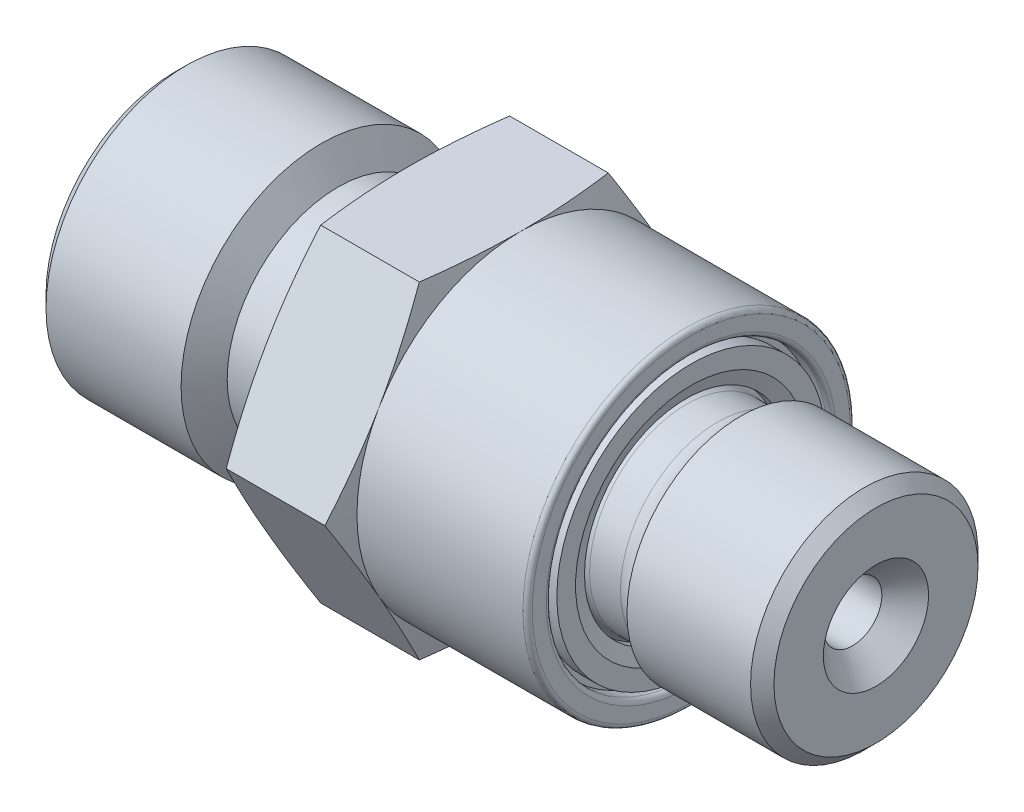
ISO-10303-21;
HEADER;
FILE_DESCRIPTION(('STEP AP214'),'2;1');
FILE_NAME('part.step','',(''),(''),'','','');
FILE_SCHEMA(('AUTOMOTIVE_DESIGN { 1 0 10303 214 1 1 1 1 }'));
ENDSEC;
DATA;
#1=APPLICATION_CONTEXT('core data for automotive mechanical design processes');
#2=APPLICATION_PROTOCOL_DEFINITION('international standard','automotive_design',2000,#1);
#3=PRODUCT_CONTEXT('',#1,'mechanical');
#4=PRODUCT('Part','Part','',(#3));
#5=PRODUCT_RELATED_PRODUCT_CATEGORY('part','',(#4));
#6=PRODUCT_DEFINITION_FORMATION('','',#4);
#7=PRODUCT_DEFINITION_CONTEXT('part definition',#1,'design');
#8=PRODUCT_DEFINITION('design','',#6,#7);
#9=PRODUCT_DEFINITION_SHAPE('','',#8);
#10=(LENGTH_UNIT() NAMED_UNIT(*) SI_UNIT(.MILLI.,.METRE.));
#11=(NAMED_UNIT(*) PLANE_ANGLE_UNIT() SI_UNIT($,.RADIAN.));
#12=(NAMED_UNIT(*) SI_UNIT($,.STERADIAN.) SOLID_ANGLE_UNIT());
#13=UNCERTAINTY_MEASURE_WITH_UNIT(LENGTH_MEASURE(1.E-05),#10,'distance_accuracy_value','');
#14=(GEOMETRIC_REPRESENTATION_CONTEXT(3) GLOBAL_UNCERTAINTY_ASSIGNED_CONTEXT((#13)) GLOBAL_UNIT_ASSIGNED_CONTEXT((#10,
#11,#12)) REPRESENTATION_CONTEXT('',''));
#15=CARTESIAN_POINT('',(0.,0.,0.));
#16=DIRECTION('',(0.,0.,1.));
#17=DIRECTION('',(1.,0.,0.));
#18=AXIS2_PLACEMENT_3D('',#15,#16,#17);
#19=CARTESIAN_POINT('',(7.1,0.,0.));
#20=DIRECTION('',(1.,0.,0.));
#21=DIRECTION('',(0.,0.,-1.));
#22=AXIS2_PLACEMENT_3D('',#19,#20,#21);
#23=PLANE('',#22);
#24=CARTESIAN_POINT('',(7.1,0.,0.));
#25=DIRECTION('',(1.,0.,0.));
#26=DIRECTION('',(0.,0.,-1.));
#27=AXIS2_PLACEMENT_3D('',#24,#25,#26);
#28=CIRCLE('',#27,5.75);
#29=CARTESIAN_POINT('',(7.1,0.,-5.75));
#30=VERTEX_POINT('',#29);
#31=EDGE_CURVE('P0_E21',#30,#30,#28,.T.);
#32=ORIENTED_EDGE('',*,*,#31,.T.);
#33=EDGE_LOOP('',(#32));
#34=FACE_BOUND('',#33,.T.);
#35=CARTESIAN_POINT('',(7.1,0.,0.));
#36=DIRECTION('',(1.,0.,0.));
#37=DIRECTION('',(0.,0.,-1.));
#38=AXIS2_PLACEMENT_3D('',#35,#36,#37);
#39=CIRCLE('',#38,4.95);
#40=CARTESIAN_POINT('',(7.1,0.,-4.95));
#41=VERTEX_POINT('',#40);
#42=EDGE_CURVE('P0_E34',#41,#41,#39,.T.);
#43=ORIENTED_EDGE('',*,*,#42,.F.);
#44=EDGE_LOOP('',(#43));
#45=FACE_BOUND('',#44,.T.);
#46=ADVANCED_FACE('P0_F14',(#34,#45),#23,.T.);
#47=CARTESIAN_POINT('',(6.4,0.,0.));
#48=DIRECTION('',(1.,0.,0.));
#49=DIRECTION('',(0.,0.,-1.));
#50=AXIS2_PLACEMENT_3D('',#47,#48,#49);
#51=CYLINDRICAL_SURFACE('',#50,4.35);
#52=CARTESIAN_POINT('',(6.4,0.,0.));
#53=DIRECTION('',(1.,0.,0.));
#54=DIRECTION('',(0.,0.,-1.));
#55=AXIS2_PLACEMENT_3D('',#52,#53,#54);
#56=CIRCLE('',#55,4.35);
#57=CARTESIAN_POINT('',(6.4,0.,-4.35));
#58=VERTEX_POINT('',#57);
#59=EDGE_CURVE('P0_E25',#58,#58,#56,.T.);
#60=ORIENTED_EDGE('',*,*,#59,.F.);
#61=EDGE_LOOP('',(#60));
#62=FACE_BOUND('',#61,.T.);
#63=CARTESIAN_POINT('',(6.88161785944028,0.,0.));
#64=DIRECTION('',(1.,0.,0.));
#65=DIRECTION('',(0.,0.,-1.));
#66=AXIS2_PLACEMENT_3D('',#63,#64,#65);
#67=CIRCLE('',#66,4.35);
#68=CARTESIAN_POINT('',(6.88161785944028,0.,-4.35));
#69=VERTEX_POINT('',#68);
#70=EDGE_CURVE('P0_E29',#69,#69,#67,.T.);
#71=ORIENTED_EDGE('',*,*,#70,.T.);
#72=EDGE_LOOP('',(#71));
#73=FACE_BOUND('',#72,.T.);
#74=ADVANCED_FACE('P0_F42',(#62,#73),#51,.F.);
#75=CARTESIAN_POINT('',(6.4,0.,0.));
#76=DIRECTION('',(1.,0.,0.));
#77=DIRECTION('',(0.,0.,-1.));
#78=AXIS2_PLACEMENT_3D('',#75,#76,#77);
#79=CYLINDRICAL_SURFACE('',#78,5.75);
#80=CARTESIAN_POINT('',(6.4,0.,0.));
#81=DIRECTION('',(1.,0.,0.));
#82=DIRECTION('',(0.,0.,-1.));
#83=AXIS2_PLACEMENT_3D('',#80,#81,#82);
#84=CIRCLE('',#83,5.75);
#85=CARTESIAN_POINT('',(6.4,0.,-5.75));
#86=VERTEX_POINT('',#85);
#87=EDGE_CURVE('P0_E9',#86,#86,#84,.T.);
#88=ORIENTED_EDGE('',*,*,#87,.T.);
#89=EDGE_LOOP('',(#88));
#90=FACE_BOUND('',#89,.T.);
#91=ORIENTED_EDGE('',*,*,#31,.F.);
#92=EDGE_LOOP('',(#91));
#93=FACE_BOUND('',#92,.T.);
#94=ADVANCED_FACE('P0_F16',(#90,#93),#79,.T.);
#95=CARTESIAN_POINT('',(6.4,0.,0.));
#96=DIRECTION('',(1.,0.,0.));
#97=DIRECTION('',(0.,0.,-1.));
#98=AXIS2_PLACEMENT_3D('',#95,#96,#97);
#99=PLANE('',#98);
#100=ORIENTED_EDGE('',*,*,#59,.T.);
#101=EDGE_LOOP('',(#100));
#102=FACE_BOUND('',#101,.T.);
#103=ORIENTED_EDGE('',*,*,#87,.F.);
#104=EDGE_LOOP('',(#103));
#105=FACE_BOUND('',#104,.T.);
#106=ADVANCED_FACE('P0_F51',(#102,#105),#99,.F.);
#107=CARTESIAN_POINT('',(6.88161785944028,0.,0.));
#108=DIRECTION('',(1.,0.,0.));
#109=DIRECTION('',(0.,0.,-1.));
#110=AXIS2_PLACEMENT_3D('',#107,#108,#109);
#111=CONICAL_SURFACE('',#110,4.35,1.22173047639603);
#112=ORIENTED_EDGE('',*,*,#42,.T.);
#113=EDGE_LOOP('',(#112));
#114=FACE_BOUND('',#113,.T.);
#115=ORIENTED_EDGE('',*,*,#70,.F.);
#116=EDGE_LOOP('',(#115));
#117=FACE_BOUND('',#116,.T.);
#118=ADVANCED_FACE('P0_F38',(#114,#117),#111,.F.);
#119=CLOSED_SHELL('',(#46,#74,#94,#106,#118));
#120=MANIFOLD_SOLID_BREP('P0_B1',#119);
#121=CARTESIAN_POINT('',(7.1,0.,0.));
#122=DIRECTION('',(1.,0.,0.));
#123=DIRECTION('',(0.,0.,-1.));
#124=AXIS2_PLACEMENT_3D('',#121,#122,#123);
#125=PLANE('',#124);
#126=CARTESIAN_POINT('',(7.1,0.,0.));
#127=DIRECTION('',(1.,0.,0.));
#128=DIRECTION('',(0.,0.,-1.));
#129=AXIS2_PLACEMENT_3D('',#126,#127,#128);
#130=CIRCLE('',#129,6.8);
#131=CARTESIAN_POINT('',(7.1,0.,-6.8));
#132=VERTEX_POINT('',#131);
#133=EDGE_CURVE('P1_E193',#132,#132,#130,.T.);
#134=ORIENTED_EDGE('',*,*,#133,.T.);
#135=EDGE_LOOP('',(#134));
#136=FACE_BOUND('',#135,.T.);
#137=CARTESIAN_POINT('',(7.1,0.,0.));
#138=DIRECTION('',(1.,0.,0.));
#139=DIRECTION('',(0.,0.,-1.));
#140=AXIS2_PLACEMENT_3D('',#137,#138,#139);
#141=CIRCLE('',#140,6.2);
#142=CARTESIAN_POINT('',(7.1,0.,-6.2));
#143=VERTEX_POINT('',#142);
#144=EDGE_CURVE('P1_E190',#143,#143,#141,.F.);
#145=ORIENTED_EDGE('',*,*,#144,.T.);
#146=EDGE_LOOP('',(#145));
#147=FACE_BOUND('',#146,.T.);
#148=ADVANCED_FACE('P1_F17',(#136,#147),#125,.T.);
#149=CARTESIAN_POINT('',(-0.2,0.,0.));
#150=DIRECTION('',(1.,0.,0.));
#151=DIRECTION('',(0.,0.,-1.));
#152=AXIS2_PLACEMENT_3D('',#149,#150,#151);
#153=CYLINDRICAL_SURFACE('',#152,7.);
#154=CARTESIAN_POINT('',(6.9,0.,0.));
#155=DIRECTION('',(1.,0.,0.));
#156=DIRECTION('',(0.,0.,-1.));
#157=AXIS2_PLACEMENT_3D('',#154,#155,#156);
#158=CIRCLE('',#157,7.);
#159=CARTESIAN_POINT('',(6.9,0.,-7.));
#160=VERTEX_POINT('',#159);
#161=EDGE_CURVE('P1_E196',#160,#160,#158,.F.);
#162=ORIENTED_EDGE('',*,*,#161,.T.);
#163=EDGE_LOOP('',(#162));
#164=FACE_BOUND('',#163,.T.);
#165=CARTESIAN_POINT('',(-0.2,0.,0.));
#166=DIRECTION('',(1.,0.,0.));
#167=DIRECTION('',(0.,0.,-1.));
#168=AXIS2_PLACEMENT_3D('',#165,#166,#167);
#169=CIRCLE('',#168,7.);
#170=CARTESIAN_POINT('',(-0.2,3.5,-6.06217782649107));
#171=VERTEX_POINT('',#170);
#172=CARTESIAN_POINT('',(-0.2,7.,0.));
#173=VERTEX_POINT('',#172);
#174=EDGE_CURVE('P1_E34',#171,#173,#169,.T.);
#175=ORIENTED_EDGE('',*,*,#174,.T.);
#176=CARTESIAN_POINT('',(-0.2,0.,0.));
#177=DIRECTION('',(1.,0.,0.));
#178=DIRECTION('',(0.,0.,-1.));
#179=AXIS2_PLACEMENT_3D('',#176,#177,#178);
#180=CIRCLE('',#179,7.);
#181=CARTESIAN_POINT('',(-0.2,3.5,6.06217782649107));
#182=VERTEX_POINT('',#181);
#183=EDGE_CURVE('P1_E140',#173,#182,#180,.T.);
#184=ORIENTED_EDGE('',*,*,#183,.T.);
#185=CARTESIAN_POINT('',(-0.2,-3.5,6.06217782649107));
#186=VERTEX_POINT('',#185);
#187=EDGE_CURVE('P1_E337',#182,#186,#180,.T.);
#188=ORIENTED_EDGE('',*,*,#187,.T.);
#189=CARTESIAN_POINT('',(-0.2,-7.,0.));
#190=VERTEX_POINT('',#189);
#191=EDGE_CURVE('P1_E335',#186,#190,#180,.T.);
#192=ORIENTED_EDGE('',*,*,#191,.T.);
#193=CARTESIAN_POINT('',(-0.2,-3.5,-6.06217782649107));
#194=VERTEX_POINT('',#193);
#195=EDGE_CURVE('P1_E331',#190,#194,#180,.T.);
#196=ORIENTED_EDGE('',*,*,#195,.T.);
#197=EDGE_CURVE('P1_E329',#194,#171,#180,.T.);
#198=ORIENTED_EDGE('',*,*,#197,.T.);
#199=EDGE_LOOP('',(#175,#184,#188,#192,#196,#198));
#200=FACE_BOUND('',#199,.T.);
#201=ADVANCED_FACE('P1_F346',(#164,#200),#153,.T.);
#202=CARTESIAN_POINT('',(-5.,0.,0.));
#203=DIRECTION('',(-1.,0.,0.));
#204=DIRECTION('',(0.,0.,1.));
#205=AXIS2_PLACEMENT_3D('',#202,#203,#204);
#206=PLANE('',#205);
#207=CARTESIAN_POINT('',(-5.,0.,0.));
#208=DIRECTION('',(-1.,0.,0.));
#209=DIRECTION('',(0.,0.,1.));
#210=AXIS2_PLACEMENT_3D('',#207,#208,#209);
#211=CIRCLE('',#210,7.);
#212=CARTESIAN_POINT('',(-5.,-3.5,6.06217782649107));
#213=VERTEX_POINT('',#212);
#214=CARTESIAN_POINT('',(-5.,-7.,0.));
#215=VERTEX_POINT('',#214);
#216=EDGE_CURVE('P1_E11',#213,#215,#211,.F.);
#217=ORIENTED_EDGE('',*,*,#216,.F.);
#218=CARTESIAN_POINT('',(-5.,3.5,6.06217782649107));
#219=VERTEX_POINT('',#218);
#220=EDGE_CURVE('P1_E22',#219,#213,#211,.F.);
#221=ORIENTED_EDGE('',*,*,#220,.F.);
#222=CARTESIAN_POINT('',(-5.,7.,0.));
#223=VERTEX_POINT('',#222);
#224=EDGE_CURVE('P1_E209',#223,#219,#211,.F.);
#225=ORIENTED_EDGE('',*,*,#224,.F.);
#226=CARTESIAN_POINT('',(-5.,0.,0.));
#227=DIRECTION('',(1.,0.,0.));
#228=DIRECTION('',(0.,0.,-1.));
#229=AXIS2_PLACEMENT_3D('',#226,#227,#228);
#230=CIRCLE('',#229,7.);
#231=CARTESIAN_POINT('',(-5.,3.5,-6.06217782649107));
#232=VERTEX_POINT('',#231);
#233=EDGE_CURVE('P1_E223',#232,#223,#230,.T.);
#234=ORIENTED_EDGE('',*,*,#233,.F.);
#235=CARTESIAN_POINT('',(-5.,-3.5,-6.06217782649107));
#236=VERTEX_POINT('',#235);
#237=EDGE_CURVE('P1_E113',#236,#232,#211,.F.);
#238=ORIENTED_EDGE('',*,*,#237,.F.);
#239=EDGE_CURVE('P1_E27',#215,#236,#211,.F.);
#240=ORIENTED_EDGE('',*,*,#239,.F.);
#241=EDGE_LOOP('',(#217,#221,#225,#234,#238,#240));
#242=FACE_BOUND('',#241,.T.);
#243=CARTESIAN_POINT('',(-5.,0.,0.));
#244=DIRECTION('',(-1.,0.,0.));
#245=DIRECTION('',(0.,0.,1.));
#246=AXIS2_PLACEMENT_3D('',#243,#244,#245);
#247=CIRCLE('',#246,5.75);
#248=CARTESIAN_POINT('',(-5.,0.,5.75));
#249=VERTEX_POINT('',#248);
#250=EDGE_CURVE('P1_E178',#249,#249,#247,.F.);
#251=ORIENTED_EDGE('',*,*,#250,.T.);
#252=EDGE_LOOP('',(#251));
#253=FACE_BOUND('',#252,.T.);
#254=ADVANCED_FACE('P1_F220',(#242,#253),#206,.T.);
#255=CARTESIAN_POINT('',(-8.72168783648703,0.,0.));
#256=DIRECTION('',(-1.,0.,0.));
#257=DIRECTION('',(0.,0.,1.));
#258=AXIS2_PLACEMENT_3D('',#255,#256,#257);
#259=CONICAL_SURFACE('',#258,6.,1.0471975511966);
#260=CARTESIAN_POINT('',(-8.,0.,0.));
#261=DIRECTION('',(1.,0.,0.));
#262=DIRECTION('',(0.,0.,-1.));
#263=AXIS2_PLACEMENT_3D('',#260,#261,#262);
#264=CIRCLE('',#263,4.75);
#265=CARTESIAN_POINT('',(-8.,0.,-4.75));
#266=VERTEX_POINT('',#265);
#267=EDGE_CURVE('P1_E324',#266,#266,#264,.T.);
#268=ORIENTED_EDGE('',*,*,#267,.F.);
#269=EDGE_LOOP('',(#268));
#270=FACE_BOUND('',#269,.T.);
#271=CARTESIAN_POINT('',(-8.72168783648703,0.,0.));
#272=DIRECTION('',(1.,0.,0.));
#273=DIRECTION('',(0.,0.,-1.));
#274=AXIS2_PLACEMENT_3D('',#271,#272,#273);
#275=CIRCLE('',#274,6.);
#276=CARTESIAN_POINT('',(-8.72168783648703,0.,-6.));
#277=VERTEX_POINT('',#276);
#278=EDGE_CURVE('P1_E327',#277,#277,#275,.T.);
#279=ORIENTED_EDGE('',*,*,#278,.T.);
#280=EDGE_LOOP('',(#279));
#281=FACE_BOUND('',#280,.T.);
#282=ADVANCED_FACE('P1_F409',(#270,#281),#259,.T.);
#283=CARTESIAN_POINT('',(0.,0.,0.));
#284=DIRECTION('',(1.,0.,0.));
#285=DIRECTION('',(0.,0.,-1.));
#286=AXIS2_PLACEMENT_3D('',#283,#284,#285);
#287=CYLINDRICAL_SURFACE('',#286,4.75);
#288=CARTESIAN_POINT('',(-6.,0.,0.));
#289=DIRECTION('',(-1.,0.,0.));
#290=DIRECTION('',(0.,0.,1.));
#291=AXIS2_PLACEMENT_3D('',#288,#289,#290);
#292=CIRCLE('',#291,4.75);
#293=CARTESIAN_POINT('',(-6.,0.,4.75));
#294=VERTEX_POINT('',#293);
#295=EDGE_CURVE('P1_E181',#294,#294,#292,.T.);
#296=ORIENTED_EDGE('',*,*,#295,.T.);
#297=EDGE_LOOP('',(#296));
#298=FACE_BOUND('',#297,.T.);
#299=ORIENTED_EDGE('',*,*,#267,.T.);
#300=EDGE_LOOP('',(#299));
#301=FACE_BOUND('',#300,.T.);
#302=ADVANCED_FACE('P1_F405',(#298,#301),#287,.T.);
#303=CARTESIAN_POINT('',(-15.,7.,-12.1243556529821));
#304=DIRECTION('',(-1.,0.,0.));
#305=DIRECTION('',(0.,0.,1.));
#306=AXIS2_PLACEMENT_3D('',#303,#304,#305);
#307=PLANE('',#306);
#308=CARTESIAN_POINT('',(-15.,0.,0.));
#309=DIRECTION('',(-1.,0.,0.));
#310=DIRECTION('',(0.,0.,1.));
#311=AXIS2_PLACEMENT_3D('',#308,#309,#310);
#312=CIRCLE('',#311,5.5);
#313=CARTESIAN_POINT('',(-15.,0.,5.5));
#314=VERTEX_POINT('',#313);
#315=EDGE_CURVE('P1_E166',#314,#314,#312,.T.);
#316=ORIENTED_EDGE('',*,*,#315,.T.);
#317=EDGE_LOOP('',(#316));
#318=FACE_BOUND('',#317,.T.);
#319=CARTESIAN_POINT('',(-15.,0.,0.));
#320=DIRECTION('',(-1.,0.,0.));
#321=DIRECTION('',(0.,0.,1.));
#322=AXIS2_PLACEMENT_3D('',#319,#320,#321);
#323=CIRCLE('',#322,4.05);
#324=CARTESIAN_POINT('',(-15.,0.,4.05));
#325=VERTEX_POINT('',#324);
#326=EDGE_CURVE('P1_E160',#325,#325,#323,.T.);
#327=ORIENTED_EDGE('',*,*,#326,.F.);
#328=EDGE_LOOP('',(#327));
#329=FACE_BOUND('',#328,.T.);
#330=ADVANCED_FACE('P1_F408',(#318,#329),#307,.T.);
#331=CARTESIAN_POINT('',(-5.,0.,0.));
#332=DIRECTION('',(-1.,0.,0.));
#333=DIRECTION('',(0.,0.,1.));
#334=AXIS2_PLACEMENT_3D('',#331,#332,#333);
#335=CYLINDRICAL_SURFACE('',#334,6.);
#336=CARTESIAN_POINT('',(-14.5,0.,0.));
#337=DIRECTION('',(-1.,0.,0.));
#338=DIRECTION('',(0.,0.,1.));
#339=AXIS2_PLACEMENT_3D('',#336,#337,#338);
#340=CIRCLE('',#339,6.);
#341=CARTESIAN_POINT('',(-14.5,0.,6.));
#342=VERTEX_POINT('',#341);
#343=EDGE_CURVE('P1_E169',#342,#342,#340,.F.);
#344=ORIENTED_EDGE('',*,*,#343,.T.);
#345=EDGE_LOOP('',(#344));
#346=FACE_BOUND('',#345,.T.);
#347=ORIENTED_EDGE('',*,*,#278,.F.);
#348=EDGE_LOOP('',(#347));
#349=FACE_BOUND('',#348,.T.);
#350=ADVANCED_FACE('P1_F414',(#346,#349),#335,.T.);
#351=CARTESIAN_POINT('',(8.8,0.,0.));
#352=DIRECTION('',(1.,0.,0.));
#353=DIRECTION('',(0.,0.,-1.));
#354=AXIS2_PLACEMENT_3D('',#351,#352,#353);
#355=CONICAL_SURFACE('',#354,4.15,1.0471975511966);
#356=CARTESIAN_POINT('',(9.08867513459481,0.,0.));
#357=DIRECTION('',(1.,0.,0.));
#358=DIRECTION('',(0.,0.,-1.));
#359=AXIS2_PLACEMENT_3D('',#356,#357,#358);
#360=CIRCLE('',#359,4.65);
#361=CARTESIAN_POINT('',(9.08867513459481,0.,-4.65));
#362=VERTEX_POINT('',#361);
#363=EDGE_CURVE('P1_E175',#362,#362,#360,.T.);
#364=ORIENTED_EDGE('',*,*,#363,.T.);
#365=EDGE_LOOP('',(#364));
#366=FACE_BOUND('',#365,.T.);
#367=CARTESIAN_POINT('',(9.2122280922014,0.,0.));
#368=DIRECTION('',(-1.,0.,0.));
#369=DIRECTION('',(0.,0.,1.));
#370=AXIS2_PLACEMENT_3D('',#367,#368,#369);
#371=CIRCLE('',#370,4.864);
#372=CARTESIAN_POINT('',(9.2122280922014,0.,4.864));
#373=VERTEX_POINT('',#372);
#374=EDGE_CURVE('P1_E321',#373,#373,#371,.T.);
#375=ORIENTED_EDGE('',*,*,#374,.T.);
#376=EDGE_LOOP('',(#375));
#377=FACE_BOUND('',#376,.T.);
#378=ADVANCED_FACE('P1_F417',(#366,#377),#355,.T.);
#379=CARTESIAN_POINT('',(-0.490956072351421,0.,0.));
#380=DIRECTION('',(-1.,0.,0.));
#381=DIRECTION('',(0.,0.,1.));
#382=AXIS2_PLACEMENT_3D('',#379,#380,#381);
#383=CYLINDRICAL_SURFACE('',#382,4.15);
#384=CARTESIAN_POINT('',(6.9,0.,0.));
#385=DIRECTION('',(1.,0.,0.));
#386=DIRECTION('',(0.,0.,-1.));
#387=AXIS2_PLACEMENT_3D('',#384,#385,#386);
#388=CIRCLE('',#387,4.15);
#389=CARTESIAN_POINT('',(6.9,0.,-4.15));
#390=VERTEX_POINT('',#389);
#391=EDGE_CURVE('P1_E187',#390,#390,#388,.T.);
#392=ORIENTED_EDGE('',*,*,#391,.T.);
#393=EDGE_LOOP('',(#392));
#394=FACE_BOUND('',#393,.T.);
#395=CARTESIAN_POINT('',(8.22264973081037,0.,0.));
#396=DIRECTION('',(-1.,0.,0.));
#397=DIRECTION('',(0.,0.,1.));
#398=AXIS2_PLACEMENT_3D('',#395,#396,#397);
#399=CIRCLE('',#398,4.15);
#400=CARTESIAN_POINT('',(8.22264973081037,0.,4.15));
#401=VERTEX_POINT('',#400);
#402=EDGE_CURVE('P1_E172',#401,#401,#399,.T.);
#403=ORIENTED_EDGE('',*,*,#402,.T.);
#404=EDGE_LOOP('',(#403));
#405=FACE_BOUND('',#404,.T.);
#406=ADVANCED_FACE('P1_F478',(#394,#405),#383,.T.);
#407=CARTESIAN_POINT('',(6.4,0.,-4.15));
#408=DIRECTION('',(1.,0.,0.));
#409=DIRECTION('',(0.,0.,-1.));
#410=AXIS2_PLACEMENT_3D('',#407,#408,#409);
#411=PLANE('',#410);
#412=CARTESIAN_POINT('',(6.4,0.,0.));
#413=DIRECTION('',(1.,0.,0.));
#414=DIRECTION('',(0.,0.,-1.));
#415=AXIS2_PLACEMENT_3D('',#412,#413,#414);
#416=CIRCLE('',#415,4.65);
#417=CARTESIAN_POINT('',(6.4,0.,-4.65));
#418=VERTEX_POINT('',#417);
#419=EDGE_CURVE('P1_E184',#418,#418,#416,.F.);
#420=ORIENTED_EDGE('',*,*,#419,.T.);
#421=EDGE_LOOP('',(#420));
#422=FACE_BOUND('',#421,.T.);
#423=CARTESIAN_POINT('',(6.4,0.,0.));
#424=DIRECTION('',(-1.,0.,0.));
#425=DIRECTION('',(0.,0.,1.));
#426=AXIS2_PLACEMENT_3D('',#423,#424,#425);
#427=CIRCLE('',#426,6.);
#428=CARTESIAN_POINT('',(6.4,0.,6.));
#429=VERTEX_POINT('',#428);
#430=EDGE_CURVE('P1_E318',#429,#429,#427,.T.);
#431=ORIENTED_EDGE('',*,*,#430,.F.);
#432=EDGE_LOOP('',(#431));
#433=FACE_BOUND('',#432,.T.);
#434=ADVANCED_FACE('P1_F433',(#422,#433),#411,.T.);
#435=CARTESIAN_POINT('',(-0.490956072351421,0.,0.));
#436=DIRECTION('',(-1.,0.,0.));
#437=DIRECTION('',(0.,0.,1.));
#438=AXIS2_PLACEMENT_3D('',#435,#436,#437);
#439=CYLINDRICAL_SURFACE('',#438,6.);
#440=CARTESIAN_POINT('',(6.9,0.,0.));
#441=DIRECTION('',(1.,0.,0.));
#442=DIRECTION('',(0.,0.,-1.));
#443=AXIS2_PLACEMENT_3D('',#440,#441,#442);
#444=CIRCLE('',#443,6.);
#445=CARTESIAN_POINT('',(6.9,0.,-6.));
#446=VERTEX_POINT('',#445);
#447=EDGE_CURVE('P1_E199',#446,#446,#444,.T.);
#448=ORIENTED_EDGE('',*,*,#447,.T.);
#449=EDGE_LOOP('',(#448));
#450=FACE_BOUND('',#449,.T.);
#451=ORIENTED_EDGE('',*,*,#430,.T.);
#452=EDGE_LOOP('',(#451));
#453=FACE_BOUND('',#452,.T.);
#454=ADVANCED_FACE('P1_F425',(#450,#453),#439,.F.);
#455=CARTESIAN_POINT('',(15.,7.,-12.1243556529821));
#456=DIRECTION('',(-1.,0.,0.));
#457=DIRECTION('',(0.,0.,1.));
#458=AXIS2_PLACEMENT_3D('',#455,#456,#457);
#459=PLANE('',#458);
#460=CARTESIAN_POINT('',(15.,0.,0.));
#461=DIRECTION('',(-1.,0.,0.));
#462=DIRECTION('',(0.,0.,1.));
#463=AXIS2_PLACEMENT_3D('',#460,#461,#462);
#464=CIRCLE('',#463,2.25);
#465=CARTESIAN_POINT('',(15.,0.,2.25));
#466=VERTEX_POINT('',#465);
#467=EDGE_CURVE('P1_E202',#466,#466,#464,.T.);
#468=ORIENTED_EDGE('',*,*,#467,.T.);
#469=EDGE_LOOP('',(#468));
#470=FACE_BOUND('',#469,.T.);
#471=CARTESIAN_POINT('',(15.,0.,0.));
#472=DIRECTION('',(-1.,0.,0.));
#473=DIRECTION('',(0.,0.,1.));
#474=AXIS2_PLACEMENT_3D('',#471,#472,#473);
#475=CIRCLE('',#474,4.364);
#476=CARTESIAN_POINT('',(15.,0.,4.364));
#477=VERTEX_POINT('',#476);
#478=EDGE_CURVE('P1_E152',#477,#477,#475,.F.);
#479=ORIENTED_EDGE('',*,*,#478,.T.);
#480=EDGE_LOOP('',(#479));
#481=FACE_BOUND('',#480,.T.);
#482=ADVANCED_FACE('P1_F423',(#470,#481),#459,.F.);
#483=CARTESIAN_POINT('',(7.1,0.,0.));
#484=DIRECTION('',(1.,0.,0.));
#485=DIRECTION('',(0.,0.,-1.));
#486=AXIS2_PLACEMENT_3D('',#483,#484,#485);
#487=CYLINDRICAL_SURFACE('',#486,4.864);
#488=CARTESIAN_POINT('',(14.5,0.,0.));
#489=DIRECTION('',(-1.,0.,0.));
#490=DIRECTION('',(0.,0.,1.));
#491=AXIS2_PLACEMENT_3D('',#488,#489,#490);
#492=CIRCLE('',#491,4.864);
#493=CARTESIAN_POINT('',(14.5,0.,4.864));
#494=VERTEX_POINT('',#493);
#495=EDGE_CURVE('P1_E163',#494,#494,#492,.T.);
#496=ORIENTED_EDGE('',*,*,#495,.T.);
#497=EDGE_LOOP('',(#496));
#498=FACE_BOUND('',#497,.T.);
#499=ORIENTED_EDGE('',*,*,#374,.F.);
#500=EDGE_LOOP('',(#499));
#501=FACE_BOUND('',#500,.T.);
#502=ADVANCED_FACE('P1_F403',(#498,#501),#487,.T.);
#503=CARTESIAN_POINT('',(-15.8710958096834,0.,0.));
#504=DIRECTION('',(-1.,0.,0.));
#505=DIRECTION('',(0.,0.,1.));
#506=AXIS2_PLACEMENT_3D('',#503,#504,#505);
#507=CYLINDRICAL_SURFACE('',#506,2.);
#508=CARTESIAN_POINT('',(-8.,0.,0.));
#509=DIRECTION('',(1.,0.,0.));
#510=DIRECTION('',(0.,0.,-1.));
#511=AXIS2_PLACEMENT_3D('',#508,#509,#510);
#512=CIRCLE('',#511,2.);
#513=CARTESIAN_POINT('',(-8.,0.,-2.));
#514=VERTEX_POINT('',#513);
#515=EDGE_CURVE('P1_E157',#514,#514,#512,.F.);
#516=ORIENTED_EDGE('',*,*,#515,.T.);
#517=EDGE_LOOP('',(#516));
#518=FACE_BOUND('',#517,.T.);
#519=CARTESIAN_POINT('',(5.,0.,0.));
#520=DIRECTION('',(-1.,0.,0.));
#521=DIRECTION('',(0.,0.,1.));
#522=AXIS2_PLACEMENT_3D('',#519,#520,#521);
#523=CIRCLE('',#522,2.);
#524=CARTESIAN_POINT('',(5.,0.,2.));
#525=VERTEX_POINT('',#524);
#526=EDGE_CURVE('P1_E156',#525,#525,#523,.T.);
#527=ORIENTED_EDGE('',*,*,#526,.F.);
#528=EDGE_LOOP('',(#527));
#529=FACE_BOUND('',#528,.T.);
#530=ADVANCED_FACE('P1_F431',(#518,#529),#507,.F.);
#531=CARTESIAN_POINT('',(5.,0.,0.));
#532=DIRECTION('',(-1.,0.,0.));
#533=DIRECTION('',(0.,0.,1.));
#534=AXIS2_PLACEMENT_3D('',#531,#532,#533);
#535=CONICAL_SURFACE('',#534,2.,1.13446401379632);
#536=CARTESIAN_POINT('',(5.34973074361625,0.,0.));
#537=DIRECTION('',(-1.,0.,0.));
#538=DIRECTION('',(0.,0.,1.));
#539=AXIS2_PLACEMENT_3D('',#536,#537,#538);
#540=CIRCLE('',#539,1.25);
#541=CARTESIAN_POINT('',(5.34973074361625,0.,1.25));
#542=VERTEX_POINT('',#541);
#543=EDGE_CURVE('P1_E153',#542,#542,#540,.F.);
#544=ORIENTED_EDGE('',*,*,#543,.T.);
#545=EDGE_LOOP('',(#544));
#546=FACE_BOUND('',#545,.T.);
#547=ORIENTED_EDGE('',*,*,#526,.T.);
#548=EDGE_LOOP('',(#547));
#549=FACE_BOUND('',#548,.T.);
#550=ADVANCED_FACE('P1_F469',(#546,#549),#535,.F.);
#551=CARTESIAN_POINT('',(-15.8974597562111,0.,0.));
#552=DIRECTION('',(-1.,0.,0.));
#553=DIRECTION('',(0.,0.,1.));
#554=AXIS2_PLACEMENT_3D('',#551,#552,#553);
#555=CYLINDRICAL_SURFACE('',#554,1.25);
#556=CARTESIAN_POINT('',(14.,0.,0.));
#557=DIRECTION('',(-1.,0.,0.));
#558=DIRECTION('',(0.,0.,1.));
#559=AXIS2_PLACEMENT_3D('',#556,#557,#558);
#560=CIRCLE('',#559,1.25);
#561=CARTESIAN_POINT('',(14.,0.,1.25));
#562=VERTEX_POINT('',#561);
#563=EDGE_CURVE('P1_E204',#562,#562,#560,.F.);
#564=ORIENTED_EDGE('',*,*,#563,.T.);
#565=EDGE_LOOP('',(#564));
#566=FACE_BOUND('',#565,.T.);
#567=ORIENTED_EDGE('',*,*,#543,.F.);
#568=EDGE_LOOP('',(#567));
#569=FACE_BOUND('',#568,.T.);
#570=ADVANCED_FACE('P1_F461',(#566,#569),#555,.F.);
#571=CARTESIAN_POINT('',(-8.,0.,3.));
#572=DIRECTION('',(1.,0.,0.));
#573=DIRECTION('',(0.,0.,-1.));
#574=AXIS2_PLACEMENT_3D('',#571,#572,#573);
#575=PLANE('',#574);
#576=CARTESIAN_POINT('',(-8.,0.,0.));
#577=DIRECTION('',(-1.,0.,0.));
#578=DIRECTION('',(0.,0.,1.));
#579=AXIS2_PLACEMENT_3D('',#576,#577,#578);
#580=CIRCLE('',#579,3.);
#581=CARTESIAN_POINT('',(-8.,0.,3.));
#582=VERTEX_POINT('',#581);
#583=EDGE_CURVE('P1_E308',#582,#582,#580,.T.);
#584=ORIENTED_EDGE('',*,*,#583,.T.);
#585=EDGE_LOOP('',(#584));
#586=FACE_BOUND('',#585,.T.);
#587=ORIENTED_EDGE('',*,*,#515,.F.);
#588=EDGE_LOOP('',(#587));
#589=FACE_BOUND('',#588,.T.);
#590=ADVANCED_FACE('P1_F459',(#586,#589),#575,.F.);
#591=CARTESIAN_POINT('',(-15.,0.,0.));
#592=DIRECTION('',(-1.,0.,0.));
#593=DIRECTION('',(0.,0.,1.));
#594=AXIS2_PLACEMENT_3D('',#591,#592,#593);
#595=CONICAL_SURFACE('',#594,4.05,0.20943951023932);
#596=CARTESIAN_POINT('',(-10.0601383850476,0.,0.));
#597=DIRECTION('',(-1.,0.,0.));
#598=DIRECTION('',(0.,0.,1.));
#599=AXIS2_PLACEMENT_3D('',#596,#597,#598);
#600=CIRCLE('',#599,3.);
#601=CARTESIAN_POINT('',(-10.0601383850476,0.,3.));
#602=VERTEX_POINT('',#601);
#603=EDGE_CURVE('P1_E311',#602,#602,#600,.T.);
#604=ORIENTED_EDGE('',*,*,#603,.F.);
#605=EDGE_LOOP('',(#604));
#606=FACE_BOUND('',#605,.T.);
#607=ORIENTED_EDGE('',*,*,#326,.T.);
#608=EDGE_LOOP('',(#607));
#609=FACE_BOUND('',#608,.T.);
#610=ADVANCED_FACE('P1_F453',(#606,#609),#595,.F.);
#611=CARTESIAN_POINT('',(-16.1874631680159,0.,0.));
#612=DIRECTION('',(-1.,0.,0.));
#613=DIRECTION('',(0.,0.,1.));
#614=AXIS2_PLACEMENT_3D('',#611,#612,#613);
#615=CYLINDRICAL_SURFACE('',#614,3.);
#616=ORIENTED_EDGE('',*,*,#583,.F.);
#617=EDGE_LOOP('',(#616));
#618=FACE_BOUND('',#617,.T.);
#619=ORIENTED_EDGE('',*,*,#603,.T.);
#620=EDGE_LOOP('',(#619));
#621=FACE_BOUND('',#620,.T.);
#622=ADVANCED_FACE('P1_F443',(#618,#621),#615,.F.);
#623=CARTESIAN_POINT('',(15.,0.,0.));
#624=DIRECTION('',(-1.,0.,0.));
#625=DIRECTION('',(0.,0.,1.));
#626=AXIS2_PLACEMENT_3D('',#623,#624,#625);
#627=CONICAL_SURFACE('',#626,4.364,0.785398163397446);
#628=ORIENTED_EDGE('',*,*,#495,.F.);
#629=EDGE_LOOP('',(#628));
#630=FACE_BOUND('',#629,.T.);
#631=ORIENTED_EDGE('',*,*,#478,.F.);
#632=EDGE_LOOP('',(#631));
#633=FACE_BOUND('',#632,.T.);
#634=ADVANCED_FACE('P1_F440',(#630,#633),#627,.T.);
#635=CARTESIAN_POINT('',(-15.,0.,0.));
#636=DIRECTION('',(1.,0.,0.));
#637=DIRECTION('',(0.,0.,-1.));
#638=AXIS2_PLACEMENT_3D('',#635,#636,#637);
#639=CONICAL_SURFACE('',#638,5.5,0.785398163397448);
#640=ORIENTED_EDGE('',*,*,#343,.F.);
#641=EDGE_LOOP('',(#640));
#642=FACE_BOUND('',#641,.T.);
#643=ORIENTED_EDGE('',*,*,#315,.F.);
#644=EDGE_LOOP('',(#643));
#645=FACE_BOUND('',#644,.T.);
#646=ADVANCED_FACE('P1_F442',(#642,#645),#639,.T.);
#647=CARTESIAN_POINT('',(8.22264973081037,0.,0.));
#648=DIRECTION('',(-1.,0.,0.));
#649=DIRECTION('',(0.,0.,1.));
#650=AXIS2_PLACEMENT_3D('',#647,#648,#649);
#651=TOROIDAL_SURFACE('',#650,5.15,1.);
#652=ORIENTED_EDGE('',*,*,#363,.F.);
#653=EDGE_LOOP('',(#652));
#654=FACE_BOUND('',#653,.T.);
#655=ORIENTED_EDGE('',*,*,#402,.F.);
#656=EDGE_LOOP('',(#655));
#657=FACE_BOUND('',#656,.T.);
#658=ADVANCED_FACE('P1_F450',(#654,#657),#651,.F.);
#659=CARTESIAN_POINT('',(-6.,0.,0.));
#660=DIRECTION('',(-1.,0.,0.));
#661=DIRECTION('',(0.,0.,1.));
#662=AXIS2_PLACEMENT_3D('',#659,#660,#661);
#663=TOROIDAL_SURFACE('',#662,5.75,1.);
#664=ORIENTED_EDGE('',*,*,#295,.F.);
#665=EDGE_LOOP('',(#664));
#666=FACE_BOUND('',#665,.T.);
#667=ORIENTED_EDGE('',*,*,#250,.F.);
#668=EDGE_LOOP('',(#667));
#669=FACE_BOUND('',#668,.T.);
#670=ADVANCED_FACE('P1_F493',(#666,#669),#663,.F.);
#671=CARTESIAN_POINT('',(6.9,0.,0.));
#672=DIRECTION('',(1.,0.,0.));
#673=DIRECTION('',(0.,0.,-1.));
#674=AXIS2_PLACEMENT_3D('',#671,#672,#673);
#675=TOROIDAL_SURFACE('',#674,4.65,0.5);
#676=ORIENTED_EDGE('',*,*,#391,.F.);
#677=EDGE_LOOP('',(#676));
#678=FACE_BOUND('',#677,.T.);
#679=ORIENTED_EDGE('',*,*,#419,.F.);
#680=EDGE_LOOP('',(#679));
#681=FACE_BOUND('',#680,.T.);
#682=ADVANCED_FACE('P1_F499',(#678,#681),#675,.F.);
#683=CARTESIAN_POINT('',(6.9,0.,0.));
#684=DIRECTION('',(1.,0.,0.));
#685=DIRECTION('',(0.,0.,-1.));
#686=AXIS2_PLACEMENT_3D('',#683,#684,#685);
#687=TOROIDAL_SURFACE('',#686,6.8,0.2);
#688=ORIENTED_EDGE('',*,*,#161,.F.);
#689=EDGE_LOOP('',(#688));
#690=FACE_BOUND('',#689,.T.);
#691=ORIENTED_EDGE('',*,*,#133,.F.);
#692=EDGE_LOOP('',(#691));
#693=FACE_BOUND('',#692,.T.);
#694=ADVANCED_FACE('P1_F505',(#690,#693),#687,.T.);
#695=CARTESIAN_POINT('',(6.9,0.,0.));
#696=DIRECTION('',(1.,0.,0.));
#697=DIRECTION('',(0.,0.,-1.));
#698=AXIS2_PLACEMENT_3D('',#695,#696,#697);
#699=TOROIDAL_SURFACE('',#698,6.2,0.2);
#700=ORIENTED_EDGE('',*,*,#447,.F.);
#701=EDGE_LOOP('',(#700));
#702=FACE_BOUND('',#701,.T.);
#703=ORIENTED_EDGE('',*,*,#144,.F.);
#704=EDGE_LOOP('',(#703));
#705=FACE_BOUND('',#704,.T.);
#706=ADVANCED_FACE('P1_F508',(#702,#705),#699,.T.);
#707=CARTESIAN_POINT('',(15.,0.,0.));
#708=DIRECTION('',(1.,0.,0.));
#709=DIRECTION('',(0.,0.,-1.));
#710=AXIS2_PLACEMENT_3D('',#707,#708,#709);
#711=CONICAL_SURFACE('',#710,2.25,0.785398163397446);
#712=ORIENTED_EDGE('',*,*,#563,.F.);
#713=EDGE_LOOP('',(#712));
#714=FACE_BOUND('',#713,.T.);
#715=ORIENTED_EDGE('',*,*,#467,.F.);
#716=EDGE_LOOP('',(#715));
#717=FACE_BOUND('',#716,.T.);
#718=ADVANCED_FACE('P1_F248',(#714,#717),#711,.F.);
#719=CARTESIAN_POINT('',(-5.,0.,0.));
#720=DIRECTION('',(1.,0.,0.));
#721=DIRECTION('',(0.,0.,-1.));
#722=AXIS2_PLACEMENT_3D('',#719,#720,#721);
#723=CONICAL_SURFACE('',#722,7.,1.30899693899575);
#724=ORIENTED_EDGE('',*,*,#220,.T.);
#725=CARTESIAN_POINT('',(-4.70980586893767,0.000200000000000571,8.08301923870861));
#726=CARTESIAN_POINT('',(-4.75479764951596,-0.290508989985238,7.91517832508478));
#727=CARTESIAN_POINT('',(-4.79564276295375,-0.581745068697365,7.74703309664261));
#728=CARTESIAN_POINT('',(-4.86740379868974,-1.16524574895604,7.41014882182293));
#729=CARTESIAN_POINT('',(-4.89831568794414,-1.4575107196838,7.24140956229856));
#730=CARTESIAN_POINT('',(-4.94840565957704,-2.04129717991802,6.90436029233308));
#731=CARTESIAN_POINT('',(-4.9676434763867,-2.33281472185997,6.73605256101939));
#732=CARTESIAN_POINT('',(-4.99343941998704,-2.91622156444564,6.39922246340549));
#733=CARTESIAN_POINT('',(-5.,-3.20811078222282,6.23070014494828));
#734=CARTESIAN_POINT('',(-5.,-3.79188921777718,5.89365550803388));
#735=CARTESIAN_POINT('',(-4.99343941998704,-4.08377843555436,5.72513318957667));
#736=CARTESIAN_POINT('',(-4.9676434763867,-4.66718527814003,5.38830309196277));
#737=CARTESIAN_POINT('',(-4.94840565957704,-4.95870282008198,5.21999536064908));
#738=CARTESIAN_POINT('',(-4.89831568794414,-5.5424892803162,4.8829460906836));
#739=CARTESIAN_POINT('',(-4.86740379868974,-5.83475425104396,4.71420683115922));
#740=CARTESIAN_POINT('',(-4.79564276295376,-6.41825493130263,4.37732255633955));
#741=CARTESIAN_POINT('',(-4.75479764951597,-6.70949101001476,4.20917732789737));
#742=CARTESIAN_POINT('',(-4.70980586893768,-7.0002,4.04133641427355));
#743=B_SPLINE_CURVE_WITH_KNOTS('',3,(#725,#726,#727,#728,#729,#730,#731,#732,#733,#734,#735,
#736,#737,#738,#739,#740,#741,#742),.UNSPECIFIED.,.F.,.F.,(4,2,2,2,2,2,2,2,4),(0.,
1.01610389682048,2.03261982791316,3.04388955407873,4.05496356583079,5.06603757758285,
6.07730730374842,7.0938232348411,8.10992713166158),.UNSPECIFIED.);
#744=CARTESIAN_POINT('',(-4.70983680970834,0.,8.08290376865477));
#745=VERTEX_POINT('',#744);
#746=EDGE_CURVE('P1_E273',#745,#213,#743,.T.);
#747=ORIENTED_EDGE('',*,*,#746,.F.);
#748=CARTESIAN_POINT('',(-4.70980586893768,7.0002,4.04133641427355));
#749=CARTESIAN_POINT('',(-4.75479764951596,6.70949101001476,4.20917732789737));
#750=CARTESIAN_POINT('',(-4.79564276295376,6.41825493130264,4.37732255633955));
#751=CARTESIAN_POINT('',(-4.86740379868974,5.83475425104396,4.71420683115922));
#752=CARTESIAN_POINT('',(-4.89831568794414,5.5424892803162,4.88294609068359));
#753=CARTESIAN_POINT('',(-4.94840565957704,4.95870282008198,5.21999536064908));
#754=CARTESIAN_POINT('',(-4.9676434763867,4.66718527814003,5.38830309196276));
#755=CARTESIAN_POINT('',(-4.99343941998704,4.08377843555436,5.72513318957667));
#756=CARTESIAN_POINT('',(-5.,3.79188921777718,5.89365550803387));
#757=CARTESIAN_POINT('',(-5.,3.20811078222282,6.23070014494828));
#758=CARTESIAN_POINT('',(-4.99343941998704,2.91622156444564,6.39922246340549));
#759=CARTESIAN_POINT('',(-4.9676434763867,2.33281472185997,6.73605256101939));
#760=CARTESIAN_POINT('',(-4.94840565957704,2.04129717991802,6.90436029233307));
#761=CARTESIAN_POINT('',(-4.89831568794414,1.4575107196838,7.24140956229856));
#762=CARTESIAN_POINT('',(-4.86740379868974,1.16524574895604,7.41014882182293));
#763=CARTESIAN_POINT('',(-4.79564276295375,0.581745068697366,7.74703309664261));
#764=CARTESIAN_POINT('',(-4.75479764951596,0.290508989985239,7.91517832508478));
#765=CARTESIAN_POINT('',(-4.70980586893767,-0.000199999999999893,8.08301923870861));
#766=B_SPLINE_CURVE_WITH_KNOTS('',3,(#748,#749,#750,#751,#752,#753,#754,#755,#756,#757,#758,
#759,#760,#761,#762,#763,#764,#765),.UNSPECIFIED.,.F.,.F.,(4,2,2,2,2,2,2,2,4),(0.,
1.01610389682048,2.03261982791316,3.04388955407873,4.05496356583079,5.06603757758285,
6.07730730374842,7.0938232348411,8.10992713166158),.UNSPECIFIED.);
#767=EDGE_CURVE('P1_E267',#219,#745,#766,.T.);
#768=ORIENTED_EDGE('',*,*,#767,.F.);
#769=EDGE_LOOP('',(#724,#747,#768));
#770=FACE_BOUND('',#769,.T.);
#771=ADVANCED_FACE('P1_F515',(#770),#723,.T.);
#772=ORIENTED_EDGE('',*,*,#224,.T.);
#773=CARTESIAN_POINT('',(-4.70983680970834,7.00000000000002,4.04145188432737));
#774=VERTEX_POINT('',#773);
#775=EDGE_CURVE('P1_E272',#774,#219,#766,.T.);
#776=ORIENTED_EDGE('',*,*,#775,.F.);
#777=CARTESIAN_POINT('',(-3.452920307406,7.,-10.6850108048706));
#778=CARTESIAN_POINT('',(-3.52406386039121,7.,-10.3675103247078));
#779=CARTESIAN_POINT('',(-3.59433629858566,7.,-10.0498110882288));
#780=CARTESIAN_POINT('',(-3.73266874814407,7.,-9.413917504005));
#781=CARTESIAN_POINT('',(-3.80072866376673,7.,-9.09572313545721));
#782=CARTESIAN_POINT('',(-3.93422527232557,7.,-8.45845581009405));
#783=CARTESIAN_POINT('',(-3.99965931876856,7.,-8.13938229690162));
#784=CARTESIAN_POINT('',(-4.12719692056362,7.,-7.50057070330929));
#785=CARTESIAN_POINT('',(-4.18930050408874,7.,-7.18083262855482));
#786=CARTESIAN_POINT('',(-4.30890525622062,7.,-6.54312832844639));
#787=CARTESIAN_POINT('',(-4.36643913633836,7.,-6.22516826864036));
#788=CARTESIAN_POINT('',(-4.47647718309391,7.,-5.58838051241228));
#789=CARTESIAN_POINT('',(-4.52898146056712,7.,-5.26955283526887));
#790=CARTESIAN_POINT('',(-4.6277768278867,7.,-4.63096867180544));
#791=CARTESIAN_POINT('',(-4.67406869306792,7.,-4.31121230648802));
#792=CARTESIAN_POINT('',(-4.75907397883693,7.,-3.6706822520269));
#793=CARTESIAN_POINT('',(-4.79778739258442,7.,-3.34990856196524));
#794=CARTESIAN_POINT('',(-4.86653823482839,7.,-2.70372739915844));
#795=CARTESIAN_POINT('',(-4.8964719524,7.,-2.37830872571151));
#796=CARTESIAN_POINT('',(-4.94559758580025,7.,-1.72665459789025));
#797=CARTESIAN_POINT('',(-4.96478974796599,7.,-1.40041916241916));
#798=CARTESIAN_POINT('',(-4.99131283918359,7.,-0.74760459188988));
#799=CARTESIAN_POINT('',(-4.99864913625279,7.,-0.421025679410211));
#800=CARTESIAN_POINT('',(-5.00100959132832,7.,0.232177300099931));
#801=CARTESIAN_POINT('',(-4.99603375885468,7.,0.558801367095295));
#802=CARTESIAN_POINT('',(-4.97404979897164,7.,1.21282460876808));
#803=CARTESIAN_POINT('',(-4.95699800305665,7.,1.54022228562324));
#804=CARTESIAN_POINT('',(-4.91183486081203,7.,2.19424686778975));
#805=CARTESIAN_POINT('',(-4.88372327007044,7.,2.52087375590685));
#806=CARTESIAN_POINT('',(-4.81785901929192,7.,3.17335419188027));
#807=CARTESIAN_POINT('',(-4.78010008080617,7.,3.49920709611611));
#808=CARTESIAN_POINT('',(-4.69651043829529,7.,4.14986446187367));
#809=CARTESIAN_POINT('',(-4.65067970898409,7.,4.47466892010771));
#810=CARTESIAN_POINT('',(-4.55570837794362,7.,5.10149841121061));
#811=CARTESIAN_POINT('',(-4.50699643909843,7.,5.40358905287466));
#812=CARTESIAN_POINT('',(-4.40485257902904,7.,6.00697518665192));
#813=CARTESIAN_POINT('',(-4.35142052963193,7.,6.30827065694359));
#814=CARTESIAN_POINT('',(-4.24069908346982,7.,6.91017637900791));
#815=CARTESIAN_POINT('',(-4.18340934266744,7.,7.2107865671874));
#816=CARTESIAN_POINT('',(-4.06567597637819,7.,7.81139020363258));
#817=CARTESIAN_POINT('',(-4.00523231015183,7.,8.11138364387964));
#818=CARTESIAN_POINT('',(-3.82002648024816,7.,9.01070304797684));
#819=CARTESIAN_POINT('',(-3.69141446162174,7.,9.60923535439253));
#820=CARTESIAN_POINT('',(-3.42722978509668,7.,10.8047091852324));
#821=CARTESIAN_POINT('',(-3.29165753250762,7.,11.4016508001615));
#822=CARTESIAN_POINT('',(-3.01696431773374,7.,12.5885348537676));
#823=CARTESIAN_POINT('',(-2.8778913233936,7.,13.1784884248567));
#824=CARTESIAN_POINT('',(-2.59626229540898,7.,14.3575723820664));
#825=CARTESIAN_POINT('',(-2.45370619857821,7.,14.9467027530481));
#826=CARTESIAN_POINT('',(-2.16619681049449,7.,16.1236092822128));
#827=CARTESIAN_POINT('',(-2.02124668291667,7.,16.7113862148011));
#828=CARTESIAN_POINT('',(-1.72936565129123,7.,17.8864278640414));
#829=CARTESIAN_POINT('',(-1.58243481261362,7.,18.47369259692));
#830=CARTESIAN_POINT('',(-1.43480231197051,7.,19.0607787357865));
#831=B_SPLINE_CURVE_WITH_KNOTS('',3,(#777,#778,#779,#780,#781,#782,#783,#784,#785,#786,#787,
#788,#789,#790,#791,#792,#793,#794,#795,#796,#797,#798,#799,#800,#801,#802,#803,#804,#805,#806,
#807,#808,#809,#810,#811,#812,#813,#814,#815,#816,#817,#818,#819,#820,#821,#822,#823,#824,#825,
#826,#827,#828,#829,#830),.UNSPECIFIED.,.F.,.F.,(4,2,2,2,2,2,2,2,2,2,2,2,2,2,2,2,2,2,2,2,2,2,2,
2,2,2,4),(0.,0.976124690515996,1.95229156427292,2.92941875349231,3.90653767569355,
4.87587568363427,5.84519232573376,6.81438788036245,7.78358430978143,8.76380661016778,
9.74400643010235,10.723762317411,11.7035174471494,12.6868337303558,13.6701717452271,
14.6541513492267,15.6381340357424,16.5560684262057,17.4740277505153,18.3920690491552,
19.3101222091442,21.1466336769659,22.9830383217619,24.8013958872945,26.6197864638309,
28.4359407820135,30.2520353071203),.UNSPECIFIED.);
#832=EDGE_CURVE('P1_E274',#223,#774,#831,.T.);
#833=ORIENTED_EDGE('',*,*,#832,.F.);
#834=EDGE_LOOP('',(#772,#776,#833));
#835=FACE_BOUND('',#834,.T.);
#836=ADVANCED_FACE('P1_F245',(#835),#723,.T.);
#837=CARTESIAN_POINT('',(-4.70980586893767,-0.000200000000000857,-8.08301923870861));
#838=CARTESIAN_POINT('',(-4.75479764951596,0.290508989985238,-7.91517832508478));
#839=CARTESIAN_POINT('',(-4.79564276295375,0.581745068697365,-7.74703309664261));
#840=CARTESIAN_POINT('',(-4.86740379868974,1.16524574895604,-7.41014882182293));
#841=CARTESIAN_POINT('',(-4.89831568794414,1.4575107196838,-7.24140956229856));
#842=CARTESIAN_POINT('',(-4.94840565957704,2.04129717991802,-6.90436029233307));
#843=CARTESIAN_POINT('',(-4.9676434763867,2.33281472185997,-6.73605256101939));
#844=CARTESIAN_POINT('',(-4.99343941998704,2.91622156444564,-6.39922246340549));
#845=CARTESIAN_POINT('',(-5.,3.20811078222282,-6.23070014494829));
#846=CARTESIAN_POINT('',(-5.,3.79188921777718,-5.89365550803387));
#847=CARTESIAN_POINT('',(-4.99343941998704,4.08377843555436,-5.72513318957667));
#848=CARTESIAN_POINT('',(-4.9676434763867,4.66718527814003,-5.38830309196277));
#849=CARTESIAN_POINT('',(-4.94840565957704,4.95870282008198,-5.21999536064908));
#850=CARTESIAN_POINT('',(-4.89831568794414,5.5424892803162,-4.8829460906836));
#851=CARTESIAN_POINT('',(-4.86740379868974,5.83475425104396,-4.71420683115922));
#852=CARTESIAN_POINT('',(-4.79564276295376,6.41825493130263,-4.37732255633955));
#853=CARTESIAN_POINT('',(-4.75479764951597,6.70949101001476,-4.20917732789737));
#854=CARTESIAN_POINT('',(-4.70980586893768,7.0002,-4.04133641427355));
#855=B_SPLINE_CURVE_WITH_KNOTS('',3,(#837,#838,#839,#840,#841,#842,#843,#844,#845,#846,#847,
#848,#849,#850,#851,#852,#853,#854),.UNSPECIFIED.,.F.,.F.,(4,2,2,2,2,2,2,2,4),(0.,
1.01610389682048,2.03261982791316,3.04388955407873,4.05496356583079,5.06603757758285,
6.07730730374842,7.0938232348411,8.10992713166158),.UNSPECIFIED.);
#856=CARTESIAN_POINT('',(-4.70983680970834,7.,-4.04145188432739));
#857=VERTEX_POINT('',#856);
#858=EDGE_CURVE('P1_E118',#232,#857,#855,.T.);
#859=ORIENTED_EDGE('',*,*,#858,.F.);
#860=ORIENTED_EDGE('',*,*,#233,.T.);
#861=EDGE_CURVE('P1_E371',#857,#223,#831,.T.);
#862=ORIENTED_EDGE('',*,*,#861,.F.);
#863=EDGE_LOOP('',(#859,#860,#862));
#864=FACE_BOUND('',#863,.T.);
#865=ADVANCED_FACE('P1_F240',(#864),#723,.T.);
#866=ORIENTED_EDGE('',*,*,#237,.T.);
#867=CARTESIAN_POINT('',(-4.70983680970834,0.,-8.08290376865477));
#868=VERTEX_POINT('',#867);
#869=EDGE_CURVE('P1_E108',#868,#232,#855,.T.);
#870=ORIENTED_EDGE('',*,*,#869,.F.);
#871=CARTESIAN_POINT('',(-4.70980586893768,-7.0002,-4.04133641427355));
#872=CARTESIAN_POINT('',(-4.75479764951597,-6.70949101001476,-4.20917732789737));
#873=CARTESIAN_POINT('',(-4.79564276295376,-6.41825493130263,-4.37732255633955));
#874=CARTESIAN_POINT('',(-4.86740379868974,-5.83475425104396,-4.71420683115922));
#875=CARTESIAN_POINT('',(-4.89831568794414,-5.5424892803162,-4.88294609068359));
#876=CARTESIAN_POINT('',(-4.94840565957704,-4.95870282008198,-5.21999536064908));
#877=CARTESIAN_POINT('',(-4.9676434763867,-4.66718527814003,-5.38830309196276));
#878=CARTESIAN_POINT('',(-4.99343941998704,-4.08377843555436,-5.72513318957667));
#879=CARTESIAN_POINT('',(-5.,-3.79188921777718,-5.89365550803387));
#880=CARTESIAN_POINT('',(-5.,-3.20811078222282,-6.23070014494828));
#881=CARTESIAN_POINT('',(-4.99343941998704,-2.91622156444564,-6.39922246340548));
#882=CARTESIAN_POINT('',(-4.9676434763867,-2.33281472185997,-6.73605256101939));
#883=CARTESIAN_POINT('',(-4.94840565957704,-2.04129717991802,-6.90436029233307));
#884=CARTESIAN_POINT('',(-4.89831568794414,-1.4575107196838,-7.24140956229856));
#885=CARTESIAN_POINT('',(-4.86740379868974,-1.16524574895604,-7.41014882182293));
#886=CARTESIAN_POINT('',(-4.79564276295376,-0.581745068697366,-7.7470330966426));
#887=CARTESIAN_POINT('',(-4.75479764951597,-0.290508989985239,-7.91517832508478));
#888=CARTESIAN_POINT('',(-4.70980586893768,0.000199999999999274,-8.0830192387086));
#889=B_SPLINE_CURVE_WITH_KNOTS('',3,(#871,#872,#873,#874,#875,#876,#877,#878,#879,#880,#881,
#882,#883,#884,#885,#886,#887,#888),.UNSPECIFIED.,.F.,.F.,(4,2,2,2,2,2,2,2,4),(0.,
1.01610389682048,2.03261982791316,3.04388955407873,4.05496356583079,5.06603757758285,
6.07730730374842,7.0938232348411,8.10992713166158),.UNSPECIFIED.);
#890=EDGE_CURVE('P1_E111',#236,#868,#889,.T.);
#891=ORIENTED_EDGE('',*,*,#890,.F.);
#892=EDGE_LOOP('',(#866,#870,#891));
#893=FACE_BOUND('',#892,.T.);
#894=ADVANCED_FACE('P1_F110',(#893),#723,.T.);
#895=ORIENTED_EDGE('',*,*,#239,.T.);
#896=CARTESIAN_POINT('',(-4.70983680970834,-7.00000000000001,-4.04145188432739));
#897=VERTEX_POINT('',#896);
#898=EDGE_CURVE('P1_E127',#897,#236,#889,.T.);
#899=ORIENTED_EDGE('',*,*,#898,.F.);
#900=CARTESIAN_POINT('',(-3.452920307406,-7.,-10.6850108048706));
#901=CARTESIAN_POINT('',(-3.52406386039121,-7.,-10.3675103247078));
#902=CARTESIAN_POINT('',(-3.59433629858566,-7.,-10.0498110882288));
#903=CARTESIAN_POINT('',(-3.73266874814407,-7.,-9.413917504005));
#904=CARTESIAN_POINT('',(-3.80072866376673,-7.,-9.09572313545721));
#905=CARTESIAN_POINT('',(-3.93422527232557,-7.,-8.45845581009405));
#906=CARTESIAN_POINT('',(-3.99965931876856,-7.,-8.13938229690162));
#907=CARTESIAN_POINT('',(-4.12719692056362,-7.,-7.50057070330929));
#908=CARTESIAN_POINT('',(-4.18930050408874,-7.,-7.18083262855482));
#909=CARTESIAN_POINT('',(-4.30890525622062,-7.,-6.54312832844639));
#910=CARTESIAN_POINT('',(-4.36643913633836,-7.,-6.22516826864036));
#911=CARTESIAN_POINT('',(-4.47647718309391,-7.,-5.58838051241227));
#912=CARTESIAN_POINT('',(-4.52898146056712,-7.,-5.26955283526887));
#913=CARTESIAN_POINT('',(-4.6277768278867,-7.,-4.63096867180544));
#914=CARTESIAN_POINT('',(-4.67406869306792,-7.,-4.31121230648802));
#915=CARTESIAN_POINT('',(-4.75907397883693,-7.,-3.6706822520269));
#916=CARTESIAN_POINT('',(-4.79778739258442,-7.,-3.34990856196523));
#917=CARTESIAN_POINT('',(-4.86653823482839,-7.,-2.70372739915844));
#918=CARTESIAN_POINT('',(-4.8964719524,-7.,-2.37830872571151));
#919=CARTESIAN_POINT('',(-4.94559758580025,-7.,-1.72665459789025));
#920=CARTESIAN_POINT('',(-4.96478974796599,-7.,-1.40041916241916));
#921=CARTESIAN_POINT('',(-4.99131283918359,-7.,-0.74760459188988));
#922=CARTESIAN_POINT('',(-4.99864913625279,-7.,-0.421025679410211));
#923=CARTESIAN_POINT('',(-5.00100959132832,-7.,0.232177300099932));
#924=CARTESIAN_POINT('',(-4.99603375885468,-7.,0.558801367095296));
#925=CARTESIAN_POINT('',(-4.97404979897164,-7.,1.21282460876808));
#926=CARTESIAN_POINT('',(-4.95699800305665,-7.,1.54022228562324));
#927=CARTESIAN_POINT('',(-4.91183486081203,-7.,2.19424686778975));
#928=CARTESIAN_POINT('',(-4.88372327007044,-7.,2.52087375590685));
#929=CARTESIAN_POINT('',(-4.81785901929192,-7.,3.17335419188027));
#930=CARTESIAN_POINT('',(-4.78010008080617,-7.,3.49920709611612));
#931=CARTESIAN_POINT('',(-4.69651043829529,-7.,4.14986446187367));
#932=CARTESIAN_POINT('',(-4.65067970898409,-7.,4.47466892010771));
#933=CARTESIAN_POINT('',(-4.55570837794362,-7.,5.10149841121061));
#934=CARTESIAN_POINT('',(-4.50699643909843,-7.,5.40358905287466));
#935=CARTESIAN_POINT('',(-4.40485257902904,-7.,6.00697518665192));
#936=CARTESIAN_POINT('',(-4.35142052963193,-7.,6.3082706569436));
#937=CARTESIAN_POINT('',(-4.24069908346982,-7.,6.91017637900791));
#938=CARTESIAN_POINT('',(-4.18340934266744,-7.,7.21078656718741));
#939=CARTESIAN_POINT('',(-4.06567597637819,-7.,7.81139020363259));
#940=CARTESIAN_POINT('',(-4.00523231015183,-7.,8.11138364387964));
#941=CARTESIAN_POINT('',(-3.82002648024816,-7.,9.01070304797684));
#942=CARTESIAN_POINT('',(-3.69141446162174,-7.,9.60923535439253));
#943=CARTESIAN_POINT('',(-3.42722978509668,-7.,10.8047091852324));
#944=CARTESIAN_POINT('',(-3.29165753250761,-7.,11.4016508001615));
#945=CARTESIAN_POINT('',(-3.01696431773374,-7.,12.5885348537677));
#946=CARTESIAN_POINT('',(-2.87789132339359,-7.,13.1784884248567));
#947=CARTESIAN_POINT('',(-2.59626229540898,-7.,14.3575723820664));
#948=CARTESIAN_POINT('',(-2.45370619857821,-7.,14.9467027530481));
#949=CARTESIAN_POINT('',(-2.16619681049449,-7.,16.1236092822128));
#950=CARTESIAN_POINT('',(-2.02124668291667,-7.,16.7113862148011));
#951=CARTESIAN_POINT('',(-1.72936565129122,-7.,17.8864278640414));
#952=CARTESIAN_POINT('',(-1.58243481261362,-7.,18.47369259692));
#953=CARTESIAN_POINT('',(-1.43480231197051,-7.,19.0607787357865));
#954=B_SPLINE_CURVE_WITH_KNOTS('',3,(#900,#901,#902,#903,#904,#905,#906,#907,#908,#909,#910,
#911,#912,#913,#914,#915,#916,#917,#918,#919,#920,#921,#922,#923,#924,#925,#926,#927,#928,#929,
#930,#931,#932,#933,#934,#935,#936,#937,#938,#939,#940,#941,#942,#943,#944,#945,#946,#947,#948,
#949,#950,#951,#952,#953),.UNSPECIFIED.,.F.,.F.,(4,2,2,2,2,2,2,2,2,2,2,2,2,2,2,2,2,2,2,2,2,2,2,
2,2,2,4),(0.,0.976124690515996,1.95229156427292,2.92941875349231,3.90653767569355,
4.87587568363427,5.84519232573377,6.81438788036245,7.78358430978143,8.76380661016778,
9.74400643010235,10.723762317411,11.7035174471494,12.6868337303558,13.6701717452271,
14.6541513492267,15.6381340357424,16.5560684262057,17.4740277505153,18.3920690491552,
19.3101222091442,21.1466336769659,22.983038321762,24.8013958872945,26.6197864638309,
28.4359407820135,30.2520353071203),.UNSPECIFIED.);
#955=EDGE_CURVE('P1_E42',#215,#897,#954,.F.);
#956=ORIENTED_EDGE('',*,*,#955,.F.);
#957=EDGE_LOOP('',(#895,#899,#956));
#958=FACE_BOUND('',#957,.T.);
#959=ADVANCED_FACE('P1_F217',(#958),#723,.T.);
#960=ORIENTED_EDGE('',*,*,#216,.T.);
#961=CARTESIAN_POINT('',(-4.70983680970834,-7.,4.0414518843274));
#962=VERTEX_POINT('',#961);
#963=EDGE_CURVE('P1_E538',#962,#215,#954,.F.);
#964=ORIENTED_EDGE('',*,*,#963,.F.);
#965=EDGE_CURVE('P1_E261',#213,#962,#743,.T.);
#966=ORIENTED_EDGE('',*,*,#965,.F.);
#967=EDGE_LOOP('',(#960,#964,#966));
#968=FACE_BOUND('',#967,.T.);
#969=ADVANCED_FACE('P1_F526',(#968),#723,.T.);
#970=CARTESIAN_POINT('',(-0.490163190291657,0.,0.));
#971=DIRECTION('',(-1.,0.,0.));
#972=DIRECTION('',(0.,0.,1.));
#973=AXIS2_PLACEMENT_3D('',#970,#971,#972);
#974=CONICAL_SURFACE('',#973,8.08290376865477,1.30899693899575);
#975=CARTESIAN_POINT('',(-0.490194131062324,7.0002,-4.04133641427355));
#976=CARTESIAN_POINT('',(-0.445202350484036,6.70949101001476,-4.20917732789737));
#977=CARTESIAN_POINT('',(-0.404357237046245,6.41825493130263,-4.37732255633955));
#978=CARTESIAN_POINT('',(-0.332596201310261,5.83475425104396,-4.71420683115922));
#979=CARTESIAN_POINT('',(-0.301684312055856,5.5424892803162,-4.8829460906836));
#980=CARTESIAN_POINT('',(-0.251594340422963,4.95870282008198,-5.21999536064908));
#981=CARTESIAN_POINT('',(-0.232356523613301,4.66718527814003,-5.38830309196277));
#982=CARTESIAN_POINT('',(-0.206560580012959,4.08377843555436,-5.72513318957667));
#983=CARTESIAN_POINT('',(-0.200000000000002,3.79188921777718,-5.89365550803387));
#984=CARTESIAN_POINT('',(-0.200000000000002,3.20811078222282,-6.23070014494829));
#985=CARTESIAN_POINT('',(-0.206560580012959,2.91622156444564,-6.39922246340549));
#986=CARTESIAN_POINT('',(-0.232356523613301,2.33281472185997,-6.73605256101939));
#987=CARTESIAN_POINT('',(-0.251594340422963,2.04129717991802,-6.90436029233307));
#988=CARTESIAN_POINT('',(-0.301684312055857,1.4575107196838,-7.24140956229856));
#989=CARTESIAN_POINT('',(-0.332596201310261,1.16524574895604,-7.41014882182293));
#990=CARTESIAN_POINT('',(-0.404357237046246,0.581745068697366,-7.74703309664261));
#991=CARTESIAN_POINT('',(-0.445202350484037,0.29050898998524,-7.91517832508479));
#992=CARTESIAN_POINT('',(-0.490194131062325,-0.000199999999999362,-8.08301923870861));
#993=B_SPLINE_CURVE_WITH_KNOTS('',3,(#975,#976,#977,#978,#979,#980,#981,#982,#983,#984,#985,
#986,#987,#988,#989,#990,#991,#992),.UNSPECIFIED.,.F.,.F.,(4,2,2,2,2,2,2,2,4),(0.,
1.01610389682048,2.03261982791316,3.04388955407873,4.05496356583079,5.06603757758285,
6.07730730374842,7.0938232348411,8.10992713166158),.UNSPECIFIED.);
#994=CARTESIAN_POINT('',(-0.490163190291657,0.,-8.08290376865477));
#995=VERTEX_POINT('',#994);
#996=EDGE_CURVE('P1_E133',#171,#995,#993,.T.);
#997=ORIENTED_EDGE('',*,*,#996,.F.);
#998=ORIENTED_EDGE('',*,*,#197,.F.);
#999=CARTESIAN_POINT('',(-0.490194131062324,0.000199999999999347,-8.0830192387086));
#1000=CARTESIAN_POINT('',(-0.445202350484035,-0.29050898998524,-7.91517832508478));
#1001=CARTESIAN_POINT('',(-0.404357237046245,-0.581745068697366,-7.7470330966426));
#1002=CARTESIAN_POINT('',(-0.33259620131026,-1.16524574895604,-7.41014882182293));
#1003=CARTESIAN_POINT('',(-0.301684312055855,-1.4575107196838,-7.24140956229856));
#1004=CARTESIAN_POINT('',(-0.251594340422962,-2.04129717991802,-6.90436029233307));
#1005=CARTESIAN_POINT('',(-0.2323565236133,-2.33281472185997,-6.73605256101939));
#1006=CARTESIAN_POINT('',(-0.206560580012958,-2.91622156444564,-6.39922246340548));
#1007=CARTESIAN_POINT('',(-0.200000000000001,-3.20811078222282,-6.23070014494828));
#1008=CARTESIAN_POINT('',(-0.200000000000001,-3.79188921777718,-5.89365550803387));
#1009=CARTESIAN_POINT('',(-0.206560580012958,-4.08377843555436,-5.72513318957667));
#1010=CARTESIAN_POINT('',(-0.2323565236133,-4.66718527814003,-5.38830309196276));
#1011=CARTESIAN_POINT('',(-0.251594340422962,-4.95870282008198,-5.21999536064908));
#1012=CARTESIAN_POINT('',(-0.301684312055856,-5.5424892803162,-4.88294609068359));
#1013=CARTESIAN_POINT('',(-0.33259620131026,-5.83475425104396,-4.71420683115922));
#1014=CARTESIAN_POINT('',(-0.404357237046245,-6.41825493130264,-4.37732255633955));
#1015=CARTESIAN_POINT('',(-0.445202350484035,-6.70949101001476,-4.20917732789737));
#1016=CARTESIAN_POINT('',(-0.490194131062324,-7.0002,-4.04133641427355));
#1017=B_SPLINE_CURVE_WITH_KNOTS('',3,(#999,#1000,#1001,#1002,#1003,#1004,#1005,#1006,#1007,
#1008,#1009,#1010,#1011,#1012,#1013,#1014,#1015,#1016),.UNSPECIFIED.,.F.,.F.,(4,2,2,2,2,2,2,2,
4),(0.,1.01610389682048,2.03261982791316,3.04388955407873,4.05496356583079,5.06603757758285,
6.07730730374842,7.0938232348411,8.10992713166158),.UNSPECIFIED.);
#1018=EDGE_CURVE('P1_E359',#995,#194,#1017,.T.);
#1019=ORIENTED_EDGE('',*,*,#1018,.F.);
#1020=EDGE_LOOP('',(#997,#998,#1019));
#1021=FACE_BOUND('',#1020,.T.);
#1022=ADVANCED_FACE('P1_F369',(#1021),#974,.T.);
#1023=CARTESIAN_POINT('',(-0.490163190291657,-7.00000000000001,-4.04145188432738));
#1024=VERTEX_POINT('',#1023);
#1025=EDGE_CURVE('P1_E356',#194,#1024,#1017,.T.);
#1026=ORIENTED_EDGE('',*,*,#1025,.F.);
#1027=ORIENTED_EDGE('',*,*,#195,.F.);
#1028=CARTESIAN_POINT('',(-1.747079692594,-7.,-10.6850108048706));
#1029=CARTESIAN_POINT('',(-1.67593613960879,-7.,-10.3675103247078));
#1030=CARTESIAN_POINT('',(-1.60566370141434,-7.,-10.0498110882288));
#1031=CARTESIAN_POINT('',(-1.46733125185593,-7.,-9.413917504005));
#1032=CARTESIAN_POINT('',(-1.39927133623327,-7.,-9.09572313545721));
#1033=CARTESIAN_POINT('',(-1.26577472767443,-7.,-8.45845581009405));
#1034=CARTESIAN_POINT('',(-1.20034068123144,-7.,-8.13938229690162));
#1035=CARTESIAN_POINT('',(-1.07280307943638,-7.,-7.50057070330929));
#1036=CARTESIAN_POINT('',(-1.01069949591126,-7.,-7.18083262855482));
#1037=CARTESIAN_POINT('',(-0.891094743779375,-7.,-6.54312832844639));
#1038=CARTESIAN_POINT('',(-0.83356086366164,-7.,-6.22516826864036));
#1039=CARTESIAN_POINT('',(-0.72352281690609,-7.,-5.58838051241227));
#1040=CARTESIAN_POINT('',(-0.671018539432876,-7.,-5.26955283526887));
#1041=CARTESIAN_POINT('',(-0.572223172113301,-7.,-4.63096867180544));
#1042=CARTESIAN_POINT('',(-0.525931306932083,-7.,-4.31121230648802));
#1043=CARTESIAN_POINT('',(-0.440926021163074,-7.,-3.6706822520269));
#1044=CARTESIAN_POINT('',(-0.40221260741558,-7.,-3.34990856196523));
#1045=CARTESIAN_POINT('',(-0.333461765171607,-7.,-2.70372739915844));
#1046=CARTESIAN_POINT('',(-0.303528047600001,-7.,-2.37830872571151));
#1047=CARTESIAN_POINT('',(-0.254402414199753,-7.,-1.72665459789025));
#1048=CARTESIAN_POINT('',(-0.235210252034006,-7.,-1.40041916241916));
#1049=CARTESIAN_POINT('',(-0.20868716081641,-7.,-0.747604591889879));
#1050=CARTESIAN_POINT('',(-0.201350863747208,-7.,-0.42102567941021));
#1051=CARTESIAN_POINT('',(-0.198990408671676,-7.,0.232177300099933));
#1052=CARTESIAN_POINT('',(-0.203966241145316,-7.,0.558801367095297));
#1053=CARTESIAN_POINT('',(-0.225950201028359,-7.,1.21282460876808));
#1054=CARTESIAN_POINT('',(-0.243001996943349,-7.,1.54022228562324));
#1055=CARTESIAN_POINT('',(-0.288165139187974,-7.,2.19424686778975));
#1056=CARTESIAN_POINT('',(-0.316276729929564,-7.,2.52087375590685));
#1057=CARTESIAN_POINT('',(-0.382140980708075,-7.,3.17335419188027));
#1058=CARTESIAN_POINT('',(-0.419899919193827,-7.,3.49920709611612));
#1059=CARTESIAN_POINT('',(-0.503489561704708,-7.,4.14986446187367));
#1060=CARTESIAN_POINT('',(-0.549320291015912,-7.,4.47466892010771));
#1061=CARTESIAN_POINT('',(-0.644291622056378,-7.,5.10149841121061));
#1062=CARTESIAN_POINT('',(-0.693003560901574,-7.,5.40358905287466));
#1063=CARTESIAN_POINT('',(-0.795147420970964,-7.,6.00697518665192));
#1064=CARTESIAN_POINT('',(-0.848579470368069,-7.,6.3082706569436));
#1065=CARTESIAN_POINT('',(-0.959300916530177,-7.,6.91017637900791));
#1066=CARTESIAN_POINT('',(-1.01659065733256,-7.,7.21078656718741));
#1067=CARTESIAN_POINT('',(-1.13432402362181,-7.,7.81139020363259));
#1068=CARTESIAN_POINT('',(-1.19476768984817,-7.,8.11138364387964));
#1069=CARTESIAN_POINT('',(-1.37997351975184,-7.,9.01070304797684));
#1070=CARTESIAN_POINT('',(-1.50858553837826,-7.,9.60923535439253));
#1071=CARTESIAN_POINT('',(-1.77277021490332,-7.,10.8047091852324));
#1072=CARTESIAN_POINT('',(-1.90834246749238,-7.,11.4016508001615));
#1073=CARTESIAN_POINT('',(-2.18303568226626,-7.,12.5885348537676));
#1074=CARTESIAN_POINT('',(-2.3221086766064,-7.,13.1784884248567));
#1075=CARTESIAN_POINT('',(-2.60373770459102,-7.,14.3575723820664));
#1076=CARTESIAN_POINT('',(-2.74629380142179,-7.,14.9467027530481));
#1077=CARTESIAN_POINT('',(-3.03380318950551,-7.,16.1236092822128));
#1078=CARTESIAN_POINT('',(-3.17875331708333,-7.,16.7113862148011));
#1079=CARTESIAN_POINT('',(-3.47063434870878,-7.,17.8864278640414));
#1080=CARTESIAN_POINT('',(-3.61756518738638,-7.,18.47369259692));
#1081=CARTESIAN_POINT('',(-3.76519768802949,-7.,19.0607787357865));
#1082=B_SPLINE_CURVE_WITH_KNOTS('',3,(#1028,#1029,#1030,#1031,#1032,#1033,#1034,#1035,#1036,
#1037,#1038,#1039,#1040,#1041,#1042,#1043,#1044,#1045,#1046,#1047,#1048,#1049,#1050,#1051,#1052,
#1053,#1054,#1055,#1056,#1057,#1058,#1059,#1060,#1061,#1062,#1063,#1064,#1065,#1066,#1067,#1068,
#1069,#1070,#1071,#1072,#1073,#1074,#1075,#1076,#1077,#1078,#1079,#1080,#1081),.UNSPECIFIED.,
.F.,.F.,(4,2,2,2,2,2,2,2,2,2,2,2,2,2,2,2,2,2,2,2,2,2,2,2,2,2,4),(0.,0.976124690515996,
1.95229156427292,2.92941875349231,3.90653767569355,4.87587568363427,5.84519232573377,
6.81438788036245,7.78358430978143,8.76380661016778,9.74400643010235,10.723762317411,
11.7035174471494,12.6868337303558,13.6701717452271,14.6541513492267,15.6381340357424,
16.5560684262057,17.4740277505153,18.3920690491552,19.3101222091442,21.1466336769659,
22.983038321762,24.8013958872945,26.6197864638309,28.4359407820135,30.2520353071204),.UNSPECIFIED.);
#1083=EDGE_CURVE('P1_E295',#1024,#190,#1082,.T.);
#1084=ORIENTED_EDGE('',*,*,#1083,.F.);
#1085=EDGE_LOOP('',(#1026,#1027,#1084));
#1086=FACE_BOUND('',#1085,.T.);
#1087=ADVANCED_FACE('P1_F367',(#1086),#974,.T.);
#1088=CARTESIAN_POINT('',(-0.490163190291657,-7.,4.0414518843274));
#1089=VERTEX_POINT('',#1088);
#1090=EDGE_CURVE('P1_E307',#190,#1089,#1082,.T.);
#1091=ORIENTED_EDGE('',*,*,#1090,.F.);
#1092=ORIENTED_EDGE('',*,*,#191,.F.);
#1093=CARTESIAN_POINT('',(-0.490194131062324,-7.0002,4.04133641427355));
#1094=CARTESIAN_POINT('',(-0.445202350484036,-6.70949101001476,4.20917732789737));
#1095=CARTESIAN_POINT('',(-0.404357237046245,-6.41825493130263,4.37732255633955));
#1096=CARTESIAN_POINT('',(-0.332596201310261,-5.83475425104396,4.71420683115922));
#1097=CARTESIAN_POINT('',(-0.301684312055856,-5.5424892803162,4.8829460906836));
#1098=CARTESIAN_POINT('',(-0.251594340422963,-4.95870282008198,5.21999536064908));
#1099=CARTESIAN_POINT('',(-0.232356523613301,-4.66718527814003,5.38830309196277));
#1100=CARTESIAN_POINT('',(-0.206560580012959,-4.08377843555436,5.72513318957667));
#1101=CARTESIAN_POINT('',(-0.200000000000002,-3.79188921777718,5.89365550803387));
#1102=CARTESIAN_POINT('',(-0.200000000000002,-3.20811078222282,6.23070014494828));
#1103=CARTESIAN_POINT('',(-0.206560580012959,-2.91622156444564,6.39922246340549));
#1104=CARTESIAN_POINT('',(-0.232356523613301,-2.33281472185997,6.73605256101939));
#1105=CARTESIAN_POINT('',(-0.251594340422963,-2.04129717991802,6.90436029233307));
#1106=CARTESIAN_POINT('',(-0.301684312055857,-1.4575107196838,7.24140956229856));
#1107=CARTESIAN_POINT('',(-0.332596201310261,-1.16524574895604,7.41014882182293));
#1108=CARTESIAN_POINT('',(-0.404357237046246,-0.581745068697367,7.74703309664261));
#1109=CARTESIAN_POINT('',(-0.445202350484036,-0.29050898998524,7.91517832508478));
#1110=CARTESIAN_POINT('',(-0.490194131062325,0.000199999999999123,8.08301923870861));
#1111=B_SPLINE_CURVE_WITH_KNOTS('',3,(#1093,#1094,#1095,#1096,#1097,#1098,#1099,#1100,#1101,
#1102,#1103,#1104,#1105,#1106,#1107,#1108,#1109,#1110),.UNSPECIFIED.,.F.,.F.,(4,2,2,2,2,2,2,2,
4),(0.,1.01610389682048,2.03261982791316,3.04388955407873,4.05496356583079,5.06603757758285,
6.07730730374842,7.0938232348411,8.10992713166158),.UNSPECIFIED.);
#1112=EDGE_CURVE('P1_E306',#1089,#186,#1111,.T.);
#1113=ORIENTED_EDGE('',*,*,#1112,.F.);
#1114=EDGE_LOOP('',(#1091,#1092,#1113));
#1115=FACE_BOUND('',#1114,.T.);
#1116=ADVANCED_FACE('P1_F246',(#1115),#974,.T.);
#1117=ORIENTED_EDGE('',*,*,#187,.F.);
#1118=CARTESIAN_POINT('',(-0.490194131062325,-0.000199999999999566,8.08301923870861));
#1119=CARTESIAN_POINT('',(-0.445202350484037,0.290508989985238,7.91517832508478));
#1120=CARTESIAN_POINT('',(-0.404357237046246,0.581745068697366,7.74703309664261));
#1121=CARTESIAN_POINT('',(-0.332596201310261,1.16524574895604,7.41014882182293));
#1122=CARTESIAN_POINT('',(-0.301684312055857,1.4575107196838,7.24140956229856));
#1123=CARTESIAN_POINT('',(-0.251594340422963,2.04129717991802,6.90436029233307));
#1124=CARTESIAN_POINT('',(-0.232356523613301,2.33281472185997,6.73605256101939));
#1125=CARTESIAN_POINT('',(-0.206560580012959,2.91622156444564,6.39922246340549));
#1126=CARTESIAN_POINT('',(-0.200000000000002,3.20811078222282,6.23070014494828));
#1127=CARTESIAN_POINT('',(-0.200000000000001,3.79188921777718,5.89365550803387));
#1128=CARTESIAN_POINT('',(-0.206560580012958,4.08377843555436,5.72513318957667));
#1129=CARTESIAN_POINT('',(-0.2323565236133,4.66718527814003,5.38830309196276));
#1130=CARTESIAN_POINT('',(-0.251594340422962,4.95870282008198,5.21999536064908));
#1131=CARTESIAN_POINT('',(-0.301684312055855,5.5424892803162,4.88294609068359));
#1132=CARTESIAN_POINT('',(-0.33259620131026,5.83475425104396,4.71420683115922));
#1133=CARTESIAN_POINT('',(-0.404357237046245,6.41825493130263,4.37732255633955));
#1134=CARTESIAN_POINT('',(-0.445202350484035,6.70949101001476,4.20917732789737));
#1135=CARTESIAN_POINT('',(-0.490194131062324,7.0002,4.04133641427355));
#1136=B_SPLINE_CURVE_WITH_KNOTS('',3,(#1118,#1119,#1120,#1121,#1122,#1123,#1124,#1125,#1126,
#1127,#1128,#1129,#1130,#1131,#1132,#1133,#1134,#1135),.UNSPECIFIED.,.F.,.F.,(4,2,2,2,2,2,2,2,
4),(0.,1.01610389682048,2.03261982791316,3.04388955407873,4.05496356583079,5.06603757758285,
6.07730730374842,7.0938232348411,8.10992713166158),.UNSPECIFIED.);
#1137=CARTESIAN_POINT('',(-0.490163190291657,0.,8.08290376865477));
#1138=VERTEX_POINT('',#1137);
#1139=EDGE_CURVE('P1_E294',#1138,#182,#1136,.T.);
#1140=ORIENTED_EDGE('',*,*,#1139,.F.);
#1141=EDGE_CURVE('P1_E300',#186,#1138,#1111,.T.);
#1142=ORIENTED_EDGE('',*,*,#1141,.F.);
#1143=EDGE_LOOP('',(#1117,#1140,#1142));
#1144=FACE_BOUND('',#1143,.T.);
#1145=ADVANCED_FACE('P1_F363',(#1144),#974,.T.);
#1146=ORIENTED_EDGE('',*,*,#183,.F.);
#1147=CARTESIAN_POINT('',(-1.747079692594,7.,-10.6850108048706));
#1148=CARTESIAN_POINT('',(-1.67593613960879,7.,-10.3675103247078));
#1149=CARTESIAN_POINT('',(-1.60566370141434,7.,-10.0498110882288));
#1150=CARTESIAN_POINT('',(-1.46733125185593,7.,-9.413917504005));
#1151=CARTESIAN_POINT('',(-1.39927133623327,7.,-9.09572313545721));
#1152=CARTESIAN_POINT('',(-1.26577472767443,7.,-8.45845581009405));
#1153=CARTESIAN_POINT('',(-1.20034068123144,7.,-8.13938229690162));
#1154=CARTESIAN_POINT('',(-1.07280307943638,7.,-7.50057070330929));
#1155=CARTESIAN_POINT('',(-1.01069949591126,7.,-7.18083262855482));
#1156=CARTESIAN_POINT('',(-0.891094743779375,7.,-6.54312832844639));
#1157=CARTESIAN_POINT('',(-0.83356086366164,7.,-6.22516826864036));
#1158=CARTESIAN_POINT('',(-0.72352281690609,7.,-5.58838051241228));
#1159=CARTESIAN_POINT('',(-0.671018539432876,7.,-5.26955283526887));
#1160=CARTESIAN_POINT('',(-0.572223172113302,7.,-4.63096867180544));
#1161=CARTESIAN_POINT('',(-0.525931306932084,7.,-4.31121230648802));
#1162=CARTESIAN_POINT('',(-0.440926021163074,7.,-3.6706822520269));
#1163=CARTESIAN_POINT('',(-0.40221260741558,7.,-3.34990856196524));
#1164=CARTESIAN_POINT('',(-0.333461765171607,7.,-2.70372739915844));
#1165=CARTESIAN_POINT('',(-0.303528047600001,7.,-2.37830872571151));
#1166=CARTESIAN_POINT('',(-0.254402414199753,7.,-1.72665459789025));
#1167=CARTESIAN_POINT('',(-0.235210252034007,7.,-1.40041916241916));
#1168=CARTESIAN_POINT('',(-0.20868716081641,7.,-0.74760459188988));
#1169=CARTESIAN_POINT('',(-0.201350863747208,7.,-0.421025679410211));
#1170=CARTESIAN_POINT('',(-0.198990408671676,7.,0.232177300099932));
#1171=CARTESIAN_POINT('',(-0.203966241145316,7.,0.558801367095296));
#1172=CARTESIAN_POINT('',(-0.22595020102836,7.,1.21282460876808));
#1173=CARTESIAN_POINT('',(-0.243001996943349,7.,1.54022228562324));
#1174=CARTESIAN_POINT('',(-0.288165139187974,7.,2.19424686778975));
#1175=CARTESIAN_POINT('',(-0.316276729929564,7.,2.52087375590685));
#1176=CARTESIAN_POINT('',(-0.382140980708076,7.,3.17335419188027));
#1177=CARTESIAN_POINT('',(-0.419899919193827,7.,3.49920709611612));
#1178=CARTESIAN_POINT('',(-0.503489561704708,7.,4.14986446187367));
#1179=CARTESIAN_POINT('',(-0.549320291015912,7.,4.47466892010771));
#1180=CARTESIAN_POINT('',(-0.644291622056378,7.,5.10149841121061));
#1181=CARTESIAN_POINT('',(-0.693003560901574,7.,5.40358905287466));
#1182=CARTESIAN_POINT('',(-0.795147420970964,7.,6.00697518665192));
#1183=CARTESIAN_POINT('',(-0.848579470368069,7.,6.30827065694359));
#1184=CARTESIAN_POINT('',(-0.959300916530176,7.,6.91017637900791));
#1185=CARTESIAN_POINT('',(-1.01659065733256,7.,7.2107865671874));
#1186=CARTESIAN_POINT('',(-1.13432402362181,7.,7.81139020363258));
#1187=CARTESIAN_POINT('',(-1.19476768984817,7.,8.11138364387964));
#1188=CARTESIAN_POINT('',(-1.37997351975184,7.,9.01070304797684));
#1189=CARTESIAN_POINT('',(-1.50858553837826,7.,9.60923535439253));
#1190=CARTESIAN_POINT('',(-1.77277021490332,7.,10.8047091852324));
#1191=CARTESIAN_POINT('',(-1.90834246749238,7.,11.4016508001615));
#1192=CARTESIAN_POINT('',(-2.18303568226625,7.,12.5885348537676));
#1193=CARTESIAN_POINT('',(-2.3221086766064,7.,13.1784884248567));
#1194=CARTESIAN_POINT('',(-2.60373770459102,7.,14.3575723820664));
#1195=CARTESIAN_POINT('',(-2.74629380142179,7.,14.9467027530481));
#1196=CARTESIAN_POINT('',(-3.03380318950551,7.,16.1236092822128));
#1197=CARTESIAN_POINT('',(-3.17875331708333,7.,16.7113862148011));
#1198=CARTESIAN_POINT('',(-3.47063434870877,7.,17.8864278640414));
#1199=CARTESIAN_POINT('',(-3.61756518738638,7.,18.47369259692));
#1200=CARTESIAN_POINT('',(-3.76519768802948,7.,19.0607787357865));
#1201=B_SPLINE_CURVE_WITH_KNOTS('',3,(#1147,#1148,#1149,#1150,#1151,#1152,#1153,#1154,#1155,
#1156,#1157,#1158,#1159,#1160,#1161,#1162,#1163,#1164,#1165,#1166,#1167,#1168,#1169,#1170,#1171,
#1172,#1173,#1174,#1175,#1176,#1177,#1178,#1179,#1180,#1181,#1182,#1183,#1184,#1185,#1186,#1187,
#1188,#1189,#1190,#1191,#1192,#1193,#1194,#1195,#1196,#1197,#1198,#1199,#1200),.UNSPECIFIED.,
.F.,.F.,(4,2,2,2,2,2,2,2,2,2,2,2,2,2,2,2,2,2,2,2,2,2,2,2,2,2,4),(0.,0.976124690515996,
1.95229156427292,2.92941875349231,3.90653767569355,4.87587568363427,5.84519232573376,
6.81438788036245,7.78358430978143,8.76380661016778,9.74400643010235,10.723762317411,
11.7035174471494,12.6868337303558,13.6701717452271,14.6541513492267,15.6381340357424,
16.5560684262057,17.4740277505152,18.3920690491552,19.3101222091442,21.1466336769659,
22.9830383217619,24.8013958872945,26.6197864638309,28.4359407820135,30.2520353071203),.UNSPECIFIED.);
#1202=CARTESIAN_POINT('',(-0.490163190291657,7.00000000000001,4.04145188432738));
#1203=VERTEX_POINT('',#1202);
#1204=EDGE_CURVE('P1_E357',#1203,#173,#1201,.F.);
#1205=ORIENTED_EDGE('',*,*,#1204,.F.);
#1206=EDGE_CURVE('P1_E287',#182,#1203,#1136,.T.);
#1207=ORIENTED_EDGE('',*,*,#1206,.F.);
#1208=EDGE_LOOP('',(#1146,#1205,#1207));
#1209=FACE_BOUND('',#1208,.T.);
#1210=ADVANCED_FACE('P1_F545',(#1209),#974,.T.);
#1211=ORIENTED_EDGE('',*,*,#174,.F.);
#1212=CARTESIAN_POINT('',(-0.490163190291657,7.00000000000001,-4.04145188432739));
#1213=VERTEX_POINT('',#1212);
#1214=EDGE_CURVE('P1_E370',#1213,#171,#993,.T.);
#1215=ORIENTED_EDGE('',*,*,#1214,.F.);
#1216=EDGE_CURVE('P1_E378',#173,#1213,#1201,.F.);
#1217=ORIENTED_EDGE('',*,*,#1216,.F.);
#1218=EDGE_LOOP('',(#1211,#1215,#1217));
#1219=FACE_BOUND('',#1218,.T.);
#1220=ADVANCED_FACE('P1_F537',(#1219),#974,.T.);
#1221=CARTESIAN_POINT('',(15.,0.,-8.08290376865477));
#1222=DIRECTION('',(0.,-0.5,0.866025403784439));
#1223=DIRECTION('',(0.,-0.866025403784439,-0.5));
#1224=AXIS2_PLACEMENT_3D('',#1221,#1222,#1223);
#1225=PLANE('',#1224);
#1226=DIRECTION('',(-1.,0.,0.));
#1227=VECTOR('',#1226,1.);
#1228=CARTESIAN_POINT('',(15.,7.,-4.04145188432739));
#1229=LINE('',#1228,#1227);
#1230=EDGE_CURVE('P1_E135',#1213,#857,#1229,.T.);
#1231=ORIENTED_EDGE('',*,*,#1230,.F.);
#1232=ORIENTED_EDGE('',*,*,#1214,.T.);
#1233=ORIENTED_EDGE('',*,*,#996,.T.);
#1234=DIRECTION('',(-1.,0.,0.));
#1235=VECTOR('',#1234,1.);
#1236=CARTESIAN_POINT('',(15.,0.,-8.08290376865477));
#1237=LINE('',#1236,#1235);
#1238=EDGE_CURVE('P1_E125',#995,#868,#1237,.T.);
#1239=ORIENTED_EDGE('',*,*,#1238,.T.);
#1240=ORIENTED_EDGE('',*,*,#869,.T.);
#1241=ORIENTED_EDGE('',*,*,#858,.T.);
#1242=EDGE_LOOP('',(#1231,#1232,#1233,#1239,#1240,#1241));
#1243=FACE_BOUND('',#1242,.T.);
#1244=ADVANCED_FACE('P1_F131',(#1243),#1225,.F.);
#1245=CARTESIAN_POINT('',(15.,-7.,-4.04145188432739));
#1246=DIRECTION('',(0.,0.5,0.866025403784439));
#1247=DIRECTION('',(0.,-0.866025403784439,0.5));
#1248=AXIS2_PLACEMENT_3D('',#1245,#1246,#1247);
#1249=PLANE('',#1248);
#1250=ORIENTED_EDGE('',*,*,#1238,.F.);
#1251=ORIENTED_EDGE('',*,*,#1018,.T.);
#1252=ORIENTED_EDGE('',*,*,#1025,.T.);
#1253=DIRECTION('',(-1.,0.,0.));
#1254=VECTOR('',#1253,1.);
#1255=CARTESIAN_POINT('',(15.,-7.,-4.04145188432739));
#1256=LINE('',#1255,#1254);
#1257=EDGE_CURVE('P1_E134',#1024,#897,#1256,.T.);
#1258=ORIENTED_EDGE('',*,*,#1257,.T.);
#1259=ORIENTED_EDGE('',*,*,#898,.T.);
#1260=ORIENTED_EDGE('',*,*,#890,.T.);
#1261=EDGE_LOOP('',(#1250,#1251,#1252,#1258,#1259,#1260));
#1262=FACE_BOUND('',#1261,.T.);
#1263=ADVANCED_FACE('P1_F123',(#1262),#1249,.F.);
#1264=CARTESIAN_POINT('',(15.,-7.,4.04145188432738));
#1265=DIRECTION('',(0.,1.,0.));
#1266=DIRECTION('',(0.,0.,1.));
#1267=AXIS2_PLACEMENT_3D('',#1264,#1265,#1266);
#1268=PLANE('',#1267);
#1269=ORIENTED_EDGE('',*,*,#1257,.F.);
#1270=ORIENTED_EDGE('',*,*,#1083,.T.);
#1271=ORIENTED_EDGE('',*,*,#1090,.T.);
#1272=DIRECTION('',(-1.,0.,0.));
#1273=VECTOR('',#1272,1.);
#1274=CARTESIAN_POINT('',(15.,-7.,4.04145188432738));
#1275=LINE('',#1274,#1273);
#1276=EDGE_CURVE('P1_E137',#1089,#962,#1275,.T.);
#1277=ORIENTED_EDGE('',*,*,#1276,.T.);
#1278=ORIENTED_EDGE('',*,*,#963,.T.);
#1279=ORIENTED_EDGE('',*,*,#955,.T.);
#1280=EDGE_LOOP('',(#1269,#1270,#1271,#1277,#1278,#1279));
#1281=FACE_BOUND('',#1280,.T.);
#1282=ADVANCED_FACE('P1_F352',(#1281),#1268,.F.);
#1283=CARTESIAN_POINT('',(15.,0.,8.08290376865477));
#1284=DIRECTION('',(0.,0.5,-0.866025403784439));
#1285=DIRECTION('',(0.,0.866025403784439,0.5));
#1286=AXIS2_PLACEMENT_3D('',#1283,#1284,#1285);
#1287=PLANE('',#1286);
#1288=ORIENTED_EDGE('',*,*,#1276,.F.);
#1289=ORIENTED_EDGE('',*,*,#1112,.T.);
#1290=ORIENTED_EDGE('',*,*,#1141,.T.);
#1291=DIRECTION('',(-1.,0.,0.));
#1292=VECTOR('',#1291,1.);
#1293=CARTESIAN_POINT('',(15.,0.,8.08290376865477));
#1294=LINE('',#1293,#1292);
#1295=EDGE_CURVE('P1_E146',#1138,#745,#1294,.T.);
#1296=ORIENTED_EDGE('',*,*,#1295,.T.);
#1297=ORIENTED_EDGE('',*,*,#746,.T.);
#1298=ORIENTED_EDGE('',*,*,#965,.T.);
#1299=EDGE_LOOP('',(#1288,#1289,#1290,#1296,#1297,#1298));
#1300=FACE_BOUND('',#1299,.T.);
#1301=ADVANCED_FACE('P1_F282',(#1300),#1287,.F.);
#1302=CARTESIAN_POINT('',(15.,7.,4.04145188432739));
#1303=DIRECTION('',(0.,-0.5,-0.866025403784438));
#1304=DIRECTION('',(0.,0.866025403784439,-0.5));
#1305=AXIS2_PLACEMENT_3D('',#1302,#1303,#1304);
#1306=PLANE('',#1305);
#1307=ORIENTED_EDGE('',*,*,#1295,.F.);
#1308=ORIENTED_EDGE('',*,*,#1139,.T.);
#1309=ORIENTED_EDGE('',*,*,#1206,.T.);
#1310=DIRECTION('',(-1.,0.,0.));
#1311=VECTOR('',#1310,1.);
#1312=CARTESIAN_POINT('',(15.,7.,4.04145188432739));
#1313=LINE('',#1312,#1311);
#1314=EDGE_CURVE('P1_E149',#1203,#774,#1313,.T.);
#1315=ORIENTED_EDGE('',*,*,#1314,.T.);
#1316=ORIENTED_EDGE('',*,*,#775,.T.);
#1317=ORIENTED_EDGE('',*,*,#767,.T.);
#1318=EDGE_LOOP('',(#1307,#1308,#1309,#1315,#1316,#1317));
#1319=FACE_BOUND('',#1318,.T.);
#1320=ADVANCED_FACE('P1_F279',(#1319),#1306,.F.);
#1321=CARTESIAN_POINT('',(15.,7.,-4.04145188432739));
#1322=DIRECTION('',(0.,-1.,0.));
#1323=DIRECTION('',(0.,0.,-1.));
#1324=AXIS2_PLACEMENT_3D('',#1321,#1322,#1323);
#1325=PLANE('',#1324);
#1326=ORIENTED_EDGE('',*,*,#1314,.F.);
#1327=ORIENTED_EDGE('',*,*,#1204,.T.);
#1328=ORIENTED_EDGE('',*,*,#1216,.T.);
#1329=ORIENTED_EDGE('',*,*,#1230,.T.);
#1330=ORIENTED_EDGE('',*,*,#861,.T.);
#1331=ORIENTED_EDGE('',*,*,#832,.T.);
#1332=EDGE_LOOP('',(#1326,#1327,#1328,#1329,#1330,#1331));
#1333=FACE_BOUND('',#1332,.T.);
#1334=ADVANCED_FACE('P1_F19',(#1333),#1325,.F.);
#1335=CLOSED_SHELL('',(#148,#201,#254,#282,#302,#330,#350,#378,#406,#434,#454,#482,#502,#530,
#550,#570,#590,#610,#622,#634,#646,#658,#670,#682,#694,#706,#718,#771,#836,#865,#894,#959,#969,
#1022,#1087,#1116,#1145,#1210,#1220,#1244,#1263,#1282,#1301,#1320,#1334));
#1336=MANIFOLD_SOLID_BREP('P1_B1',#1335);
#1337=ADVANCED_BREP_SHAPE_REPRESENTATION('',(#18,#120,#1336),#14);
#1338=SHAPE_DEFINITION_REPRESENTATION(#9,#1337);
ENDSEC;
END-ISO-10303-21;
